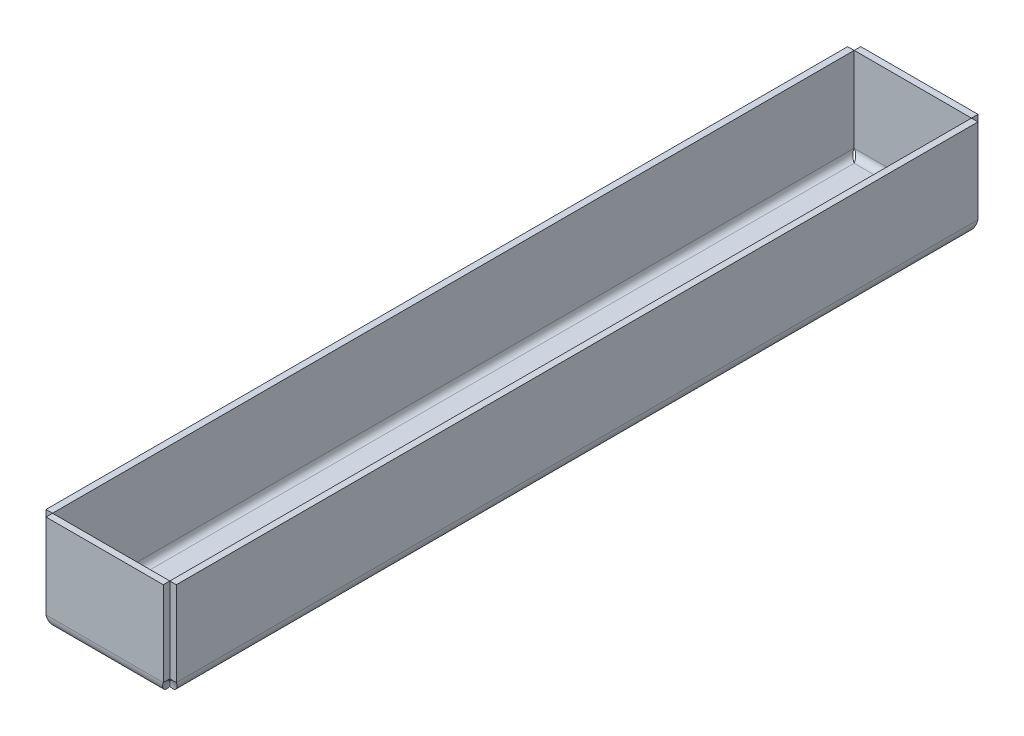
ISO-10303-21;
HEADER;
FILE_DESCRIPTION(('STEP AP214'),'2;1');
FILE_NAME('part.step','',(''),(''),'','','');
FILE_SCHEMA(('AUTOMOTIVE_DESIGN { 1 0 10303 214 1 1 1 1 }'));
ENDSEC;
DATA;
#1=APPLICATION_CONTEXT('core data for automotive mechanical design processes');
#2=APPLICATION_PROTOCOL_DEFINITION('international standard','automotive_design',2000,#1);
#3=PRODUCT_CONTEXT('',#1,'mechanical');
#4=PRODUCT('Part','Part','',(#3));
#5=PRODUCT_RELATED_PRODUCT_CATEGORY('part','',(#4));
#6=PRODUCT_DEFINITION_FORMATION('','',#4);
#7=PRODUCT_DEFINITION_CONTEXT('part definition',#1,'design');
#8=PRODUCT_DEFINITION('design','',#6,#7);
#9=PRODUCT_DEFINITION_SHAPE('','',#8);
#10=(LENGTH_UNIT() NAMED_UNIT(*) SI_UNIT(.MILLI.,.METRE.));
#11=(NAMED_UNIT(*) PLANE_ANGLE_UNIT() SI_UNIT($,.RADIAN.));
#12=(NAMED_UNIT(*) SI_UNIT($,.STERADIAN.) SOLID_ANGLE_UNIT());
#13=UNCERTAINTY_MEASURE_WITH_UNIT(LENGTH_MEASURE(1.E-05),#10,'distance_accuracy_value','');
#14=(GEOMETRIC_REPRESENTATION_CONTEXT(3) GLOBAL_UNCERTAINTY_ASSIGNED_CONTEXT((#13)) GLOBAL_UNIT_ASSIGNED_CONTEXT((#10,
#11,#12)) REPRESENTATION_CONTEXT('',''));
#15=CARTESIAN_POINT('',(0.,0.,0.));
#16=DIRECTION('',(0.,0.,1.));
#17=DIRECTION('',(1.,0.,0.));
#18=AXIS2_PLACEMENT_3D('',#15,#16,#17);
#19=CARTESIAN_POINT('',(476.700557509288,15.,125.));
#20=DIRECTION('',(0.,1.,0.));
#21=DIRECTION('',(-1.,0.,0.));
#22=AXIS2_PLACEMENT_3D('',#19,#20,#21);
#23=PLANE('',#22);
#24=DIRECTION('',(0.,0.,-1.));
#25=VECTOR('',#24,1.);
#26=CARTESIAN_POINT('',(-20.,15.,125.));
#27=LINE('',#26,#25);
#28=CARTESIAN_POINT('',(-20.,15.,122.99));
#29=VERTEX_POINT('',#28);
#30=CARTESIAN_POINT('',(-20.,15.,-122.99));
#31=VERTEX_POINT('',#30);
#32=EDGE_CURVE('E275',#29,#31,#27,.T.);
#33=ORIENTED_EDGE('',*,*,#32,.F.);
#34=DIRECTION('',(-1.,0.,0.));
#35=VECTOR('',#34,1.);
#36=CARTESIAN_POINT('',(476.700557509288,15.,122.99));
#37=LINE('',#36,#35);
#38=CARTESIAN_POINT('',(-18.,15.,122.99));
#39=VERTEX_POINT('',#38);
#40=EDGE_CURVE('E42',#39,#29,#37,.T.);
#41=ORIENTED_EDGE('',*,*,#40,.F.);
#42=DIRECTION('',(0.,0.,-1.));
#43=VECTOR('',#42,1.);
#44=CARTESIAN_POINT('',(-18.,15.,125.));
#45=LINE('',#44,#43);
#46=CARTESIAN_POINT('',(-18.,15.,-122.99));
#47=VERTEX_POINT('',#46);
#48=EDGE_CURVE('E50',#39,#47,#45,.T.);
#49=ORIENTED_EDGE('',*,*,#48,.T.);
#50=DIRECTION('',(-1.,0.,0.));
#51=VECTOR('',#50,1.);
#52=CARTESIAN_POINT('',(476.700557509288,15.,-122.99));
#53=LINE('',#52,#51);
#54=EDGE_CURVE('E249',#47,#31,#53,.T.);
#55=ORIENTED_EDGE('',*,*,#54,.T.);
#56=EDGE_LOOP('',(#33,#41,#49,#55));
#57=FACE_BOUND('',#56,.T.);
#58=ADVANCED_FACE('F31',(#57),#23,.T.);
#59=CARTESIAN_POINT('',(476.700557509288,-12.9999999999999,-122.99));
#60=DIRECTION('',(0.,0.,1.));
#61=DIRECTION('',(0.,-1.,0.));
#62=AXIS2_PLACEMENT_3D('',#59,#60,#61);
#63=PLANE('',#62);
#64=CARTESIAN_POINT('',(-20.,-11.,-122.99));
#65=CARTESIAN_POINT('',(-18.,-11.,-122.99));
#66=B_SPLINE_CURVE_WITH_KNOTS('',1,(#64,#65),.UNSPECIFIED.,.F.,.F.,(2,2),(0.,1.),.UNSPECIFIED.);
#67=CARTESIAN_POINT('',(-18.,-11.,-122.99));
#68=VERTEX_POINT('',#67);
#69=CARTESIAN_POINT('',(-20.,-11.,-122.99));
#70=VERTEX_POINT('',#69);
#71=EDGE_CURVE('E237',#68,#70,#66,.F.);
#72=ORIENTED_EDGE('',*,*,#71,.T.);
#73=DIRECTION('',(0.,1.,0.));
#74=VECTOR('',#73,1.);
#75=CARTESIAN_POINT('',(-20.,-15.,-122.99));
#76=LINE('',#75,#74);
#77=EDGE_CURVE('E65',#70,#31,#76,.T.);
#78=ORIENTED_EDGE('',*,*,#77,.T.);
#79=ORIENTED_EDGE('',*,*,#54,.F.);
#80=DIRECTION('',(0.,1.,0.));
#81=VECTOR('',#80,1.);
#82=CARTESIAN_POINT('',(-18.,-13.,-122.99));
#83=LINE('',#82,#81);
#84=EDGE_CURVE('E11',#68,#47,#83,.T.);
#85=ORIENTED_EDGE('',*,*,#84,.F.);
#86=EDGE_LOOP('',(#72,#78,#79,#85));
#87=FACE_BOUND('',#86,.T.);
#88=ADVANCED_FACE('F268',(#87),#63,.F.);
#89=CARTESIAN_POINT('',(-20.,15.,125.));
#90=DIRECTION('',(1.,0.,0.));
#91=DIRECTION('',(0.,1.,0.));
#92=AXIS2_PLACEMENT_3D('',#89,#90,#91);
#93=PLANE('',#92);
#94=ORIENTED_EDGE('',*,*,#77,.F.);
#95=DIRECTION('',(0.,0.,1.));
#96=VECTOR('',#95,1.);
#97=CARTESIAN_POINT('',(-20.,-11.,-122.99));
#98=LINE('',#97,#96);
#99=CARTESIAN_POINT('',(-20.,-11.,122.99));
#100=VERTEX_POINT('',#99);
#101=EDGE_CURVE('E278',#70,#100,#98,.T.);
#102=ORIENTED_EDGE('',*,*,#101,.T.);
#103=DIRECTION('',(0.,1.,0.));
#104=VECTOR('',#103,1.);
#105=CARTESIAN_POINT('',(-20.,-13.,122.99));
#106=LINE('',#105,#104);
#107=EDGE_CURVE('E281',#100,#29,#106,.T.);
#108=ORIENTED_EDGE('',*,*,#107,.T.);
#109=ORIENTED_EDGE('',*,*,#32,.T.);
#110=EDGE_LOOP('',(#94,#102,#108,#109));
#111=FACE_BOUND('',#110,.T.);
#112=ADVANCED_FACE('F304',(#111),#93,.F.);
#113=CARTESIAN_POINT('',(476.700557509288,-12.9999999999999,122.99));
#114=DIRECTION('',(0.,0.,1.));
#115=DIRECTION('',(0.,-1.,0.));
#116=AXIS2_PLACEMENT_3D('',#113,#114,#115);
#117=PLANE('',#116);
#118=ORIENTED_EDGE('',*,*,#107,.F.);
#119=CARTESIAN_POINT('',(-18.,-11.,122.99));
#120=CARTESIAN_POINT('',(-20.,-11.,122.99));
#121=B_SPLINE_CURVE_WITH_KNOTS('',1,(#119,#120),.UNSPECIFIED.,.F.,.F.,(2,2),(0.,1.),.UNSPECIFIED.);
#122=CARTESIAN_POINT('',(-18.,-11.,122.99));
#123=VERTEX_POINT('',#122);
#124=EDGE_CURVE('E266',#123,#100,#121,.T.);
#125=ORIENTED_EDGE('',*,*,#124,.F.);
#126=DIRECTION('',(0.,1.,0.));
#127=VECTOR('',#126,1.);
#128=CARTESIAN_POINT('',(-18.,-13.,122.99));
#129=LINE('',#128,#127);
#130=EDGE_CURVE('E264',#123,#39,#129,.T.);
#131=ORIENTED_EDGE('',*,*,#130,.T.);
#132=ORIENTED_EDGE('',*,*,#40,.T.);
#133=EDGE_LOOP('',(#118,#125,#131,#132));
#134=FACE_BOUND('',#133,.T.);
#135=ADVANCED_FACE('F307',(#134),#117,.T.);
#136=CARTESIAN_POINT('',(-18.,15.,125.));
#137=DIRECTION('',(1.,0.,0.));
#138=DIRECTION('',(0.,1.,0.));
#139=AXIS2_PLACEMENT_3D('',#136,#137,#138);
#140=PLANE('',#139);
#141=DIRECTION('',(0.,0.,1.));
#142=VECTOR('',#141,1.);
#143=CARTESIAN_POINT('',(-18.,-11.,-122.99));
#144=LINE('',#143,#142);
#145=EDGE_CURVE('E258',#68,#123,#144,.T.);
#146=ORIENTED_EDGE('',*,*,#145,.F.);
#147=ORIENTED_EDGE('',*,*,#84,.T.);
#148=ORIENTED_EDGE('',*,*,#48,.F.);
#149=ORIENTED_EDGE('',*,*,#130,.F.);
#150=EDGE_LOOP('',(#146,#147,#148,#149));
#151=FACE_BOUND('',#150,.T.);
#152=ADVANCED_FACE('F33',(#151),#140,.T.);
#153=CARTESIAN_POINT('',(-476.700557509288,15.0000000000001,125.));
#154=DIRECTION('',(0.,-1.,0.));
#155=DIRECTION('',(1.,0.,0.));
#156=AXIS2_PLACEMENT_3D('',#153,#154,#155);
#157=PLANE('',#156);
#158=DIRECTION('',(1.,0.,0.));
#159=VECTOR('',#158,1.);
#160=CARTESIAN_POINT('',(-476.700557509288,15.0000000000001,122.99));
#161=LINE('',#160,#159);
#162=CARTESIAN_POINT('',(18.,15.,122.99));
#163=VERTEX_POINT('',#162);
#164=CARTESIAN_POINT('',(20.,15.,122.99));
#165=VERTEX_POINT('',#164);
#166=EDGE_CURVE('E364',#163,#165,#161,.T.);
#167=ORIENTED_EDGE('',*,*,#166,.T.);
#168=DIRECTION('',(0.,0.,-1.));
#169=VECTOR('',#168,1.);
#170=CARTESIAN_POINT('',(20.,15.,125.));
#171=LINE('',#170,#169);
#172=CARTESIAN_POINT('',(20.,15.,-122.99));
#173=VERTEX_POINT('',#172);
#174=EDGE_CURVE('E1073',#165,#173,#171,.T.);
#175=ORIENTED_EDGE('',*,*,#174,.T.);
#176=DIRECTION('',(1.,0.,0.));
#177=VECTOR('',#176,1.);
#178=CARTESIAN_POINT('',(-476.700557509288,15.0000000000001,-122.99));
#179=LINE('',#178,#177);
#180=CARTESIAN_POINT('',(18.,15.,-122.99));
#181=VERTEX_POINT('',#180);
#182=EDGE_CURVE('E365',#181,#173,#179,.T.);
#183=ORIENTED_EDGE('',*,*,#182,.F.);
#184=DIRECTION('',(0.,0.,-1.));
#185=VECTOR('',#184,1.);
#186=CARTESIAN_POINT('',(18.,15.,125.));
#187=LINE('',#186,#185);
#188=EDGE_CURVE('E83',#163,#181,#187,.T.);
#189=ORIENTED_EDGE('',*,*,#188,.F.);
#190=EDGE_LOOP('',(#167,#175,#183,#189));
#191=FACE_BOUND('',#190,.T.);
#192=ADVANCED_FACE('F315',(#191),#157,.F.);
#193=CARTESIAN_POINT('',(-476.700557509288,-12.9999999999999,122.99));
#194=DIRECTION('',(0.,0.,-1.));
#195=DIRECTION('',(0.,-1.,0.));
#196=AXIS2_PLACEMENT_3D('',#193,#194,#195);
#197=PLANE('',#196);
#198=CARTESIAN_POINT('',(20.,-11.,122.99));
#199=CARTESIAN_POINT('',(18.,-11.,122.99));
#200=B_SPLINE_CURVE_WITH_KNOTS('',1,(#198,#199),.UNSPECIFIED.,.F.,.F.,(2,2),(0.,1.),.UNSPECIFIED.);
#201=CARTESIAN_POINT('',(18.,-11.,122.99));
#202=VERTEX_POINT('',#201);
#203=CARTESIAN_POINT('',(20.,-11.,122.99));
#204=VERTEX_POINT('',#203);
#205=EDGE_CURVE('E362',#202,#204,#200,.F.);
#206=ORIENTED_EDGE('',*,*,#205,.T.);
#207=DIRECTION('',(0.,1.,0.));
#208=VECTOR('',#207,1.);
#209=CARTESIAN_POINT('',(20.,-15.,122.99));
#210=LINE('',#209,#208);
#211=EDGE_CURVE('E98',#204,#165,#210,.T.);
#212=ORIENTED_EDGE('',*,*,#211,.T.);
#213=ORIENTED_EDGE('',*,*,#166,.F.);
#214=DIRECTION('',(0.,1.,0.));
#215=VECTOR('',#214,1.);
#216=CARTESIAN_POINT('',(18.,-13.,122.99));
#217=LINE('',#216,#215);
#218=EDGE_CURVE('E353',#202,#163,#217,.T.);
#219=ORIENTED_EDGE('',*,*,#218,.F.);
#220=EDGE_LOOP('',(#206,#212,#213,#219));
#221=FACE_BOUND('',#220,.T.);
#222=ADVANCED_FACE('F361',(#221),#197,.F.);
#223=CARTESIAN_POINT('',(20.,15.,125.));
#224=DIRECTION('',(-1.,0.,0.));
#225=DIRECTION('',(0.,-1.,0.));
#226=AXIS2_PLACEMENT_3D('',#223,#224,#225);
#227=PLANE('',#226);
#228=ORIENTED_EDGE('',*,*,#211,.F.);
#229=DIRECTION('',(0.,0.,-1.));
#230=VECTOR('',#229,1.);
#231=CARTESIAN_POINT('',(20.,-11.,122.99));
#232=LINE('',#231,#230);
#233=CARTESIAN_POINT('',(20.,-11.,-122.99));
#234=VERTEX_POINT('',#233);
#235=EDGE_CURVE('E378',#204,#234,#232,.T.);
#236=ORIENTED_EDGE('',*,*,#235,.T.);
#237=DIRECTION('',(0.,1.,0.));
#238=VECTOR('',#237,1.);
#239=CARTESIAN_POINT('',(20.,-13.,-122.99));
#240=LINE('',#239,#238);
#241=EDGE_CURVE('E374',#234,#173,#240,.T.);
#242=ORIENTED_EDGE('',*,*,#241,.T.);
#243=ORIENTED_EDGE('',*,*,#174,.F.);
#244=EDGE_LOOP('',(#228,#236,#242,#243));
#245=FACE_BOUND('',#244,.T.);
#246=ADVANCED_FACE('F339',(#245),#227,.F.);
#247=CARTESIAN_POINT('',(-476.700557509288,-12.9999999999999,-122.99));
#248=DIRECTION('',(0.,0.,-1.));
#249=DIRECTION('',(0.,-1.,0.));
#250=AXIS2_PLACEMENT_3D('',#247,#248,#249);
#251=PLANE('',#250);
#252=ORIENTED_EDGE('',*,*,#241,.F.);
#253=CARTESIAN_POINT('',(18.,-11.,-122.99));
#254=CARTESIAN_POINT('',(20.,-11.,-122.99));
#255=B_SPLINE_CURVE_WITH_KNOTS('',1,(#253,#254),.UNSPECIFIED.,.F.,.F.,(2,2),(0.,1.),.UNSPECIFIED.);
#256=CARTESIAN_POINT('',(18.,-11.,-122.99));
#257=VERTEX_POINT('',#256);
#258=EDGE_CURVE('E359',#257,#234,#255,.T.);
#259=ORIENTED_EDGE('',*,*,#258,.F.);
#260=DIRECTION('',(0.,1.,0.));
#261=VECTOR('',#260,1.);
#262=CARTESIAN_POINT('',(18.,-13.,-122.99));
#263=LINE('',#262,#261);
#264=EDGE_CURVE('E354',#257,#181,#263,.T.);
#265=ORIENTED_EDGE('',*,*,#264,.T.);
#266=ORIENTED_EDGE('',*,*,#182,.T.);
#267=EDGE_LOOP('',(#252,#259,#265,#266));
#268=FACE_BOUND('',#267,.T.);
#269=ADVANCED_FACE('F329',(#268),#251,.T.);
#270=CARTESIAN_POINT('',(18.,15.,125.));
#271=DIRECTION('',(-1.,0.,0.));
#272=DIRECTION('',(0.,-1.,0.));
#273=AXIS2_PLACEMENT_3D('',#270,#271,#272);
#274=PLANE('',#273);
#275=DIRECTION('',(0.,0.,-1.));
#276=VECTOR('',#275,1.);
#277=CARTESIAN_POINT('',(18.,-11.,122.99));
#278=LINE('',#277,#276);
#279=EDGE_CURVE('E351',#202,#257,#278,.T.);
#280=ORIENTED_EDGE('',*,*,#279,.F.);
#281=ORIENTED_EDGE('',*,*,#218,.T.);
#282=ORIENTED_EDGE('',*,*,#188,.T.);
#283=ORIENTED_EDGE('',*,*,#264,.F.);
#284=EDGE_LOOP('',(#280,#281,#282,#283));
#285=FACE_BOUND('',#284,.T.);
#286=ADVANCED_FACE('F338',(#285),#274,.T.);
#287=CARTESIAN_POINT('',(-20.,15.,34.2180108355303));
#288=DIRECTION('',(0.,1.,0.));
#289=DIRECTION('',(0.,0.,1.));
#290=AXIS2_PLACEMENT_3D('',#287,#288,#289);
#291=PLANE('',#290);
#292=DIRECTION('',(0.,0.,1.));
#293=VECTOR('',#292,1.);
#294=CARTESIAN_POINT('',(-17.99,15.,34.2180108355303));
#295=LINE('',#294,#293);
#296=CARTESIAN_POINT('',(-17.99,15.,123.));
#297=VERTEX_POINT('',#296);
#298=CARTESIAN_POINT('',(-17.99,15.,125.));
#299=VERTEX_POINT('',#298);
#300=EDGE_CURVE('E492',#297,#299,#295,.T.);
#301=ORIENTED_EDGE('',*,*,#300,.T.);
#302=DIRECTION('',(-1.,0.,0.));
#303=VECTOR('',#302,1.);
#304=CARTESIAN_POINT('',(-20.,15.,125.));
#305=LINE('',#304,#303);
#306=CARTESIAN_POINT('',(17.99,15.,125.));
#307=VERTEX_POINT('',#306);
#308=EDGE_CURVE('E487',#307,#299,#305,.T.);
#309=ORIENTED_EDGE('',*,*,#308,.F.);
#310=DIRECTION('',(0.,0.,1.));
#311=VECTOR('',#310,1.);
#312=CARTESIAN_POINT('',(17.99,15.,34.2180108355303));
#313=LINE('',#312,#311);
#314=CARTESIAN_POINT('',(17.99,15.,123.));
#315=VERTEX_POINT('',#314);
#316=EDGE_CURVE('E485',#315,#307,#313,.T.);
#317=ORIENTED_EDGE('',*,*,#316,.F.);
#318=DIRECTION('',(-1.,0.,0.));
#319=VECTOR('',#318,1.);
#320=CARTESIAN_POINT('',(-20.,15.,123.));
#321=LINE('',#320,#319);
#322=EDGE_CURVE('E489',#315,#297,#321,.T.);
#323=ORIENTED_EDGE('',*,*,#322,.T.);
#324=EDGE_LOOP('',(#301,#309,#317,#323));
#325=FACE_BOUND('',#324,.T.);
#326=ADVANCED_FACE('F343',(#325),#291,.T.);
#327=CARTESIAN_POINT('',(-17.99,-13.,34.2180108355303));
#328=DIRECTION('',(1.,0.,0.));
#329=DIRECTION('',(0.,-1.,0.));
#330=AXIS2_PLACEMENT_3D('',#327,#328,#329);
#331=PLANE('',#330);
#332=DIRECTION('',(0.,1.,0.));
#333=VECTOR('',#332,1.);
#334=CARTESIAN_POINT('',(-17.99,-15.,125.));
#335=LINE('',#334,#333);
#336=CARTESIAN_POINT('',(-17.99,-11.,125.));
#337=VERTEX_POINT('',#336);
#338=EDGE_CURVE('E491',#337,#299,#335,.T.);
#339=ORIENTED_EDGE('',*,*,#338,.T.);
#340=ORIENTED_EDGE('',*,*,#300,.F.);
#341=DIRECTION('',(0.,1.,0.));
#342=VECTOR('',#341,1.);
#343=CARTESIAN_POINT('',(-17.99,-13.,123.));
#344=LINE('',#343,#342);
#345=CARTESIAN_POINT('',(-17.99,-11.,123.));
#346=VERTEX_POINT('',#345);
#347=EDGE_CURVE('E143',#346,#297,#344,.T.);
#348=ORIENTED_EDGE('',*,*,#347,.F.);
#349=CARTESIAN_POINT('',(-17.99,-11.,125.));
#350=CARTESIAN_POINT('',(-17.99,-11.,123.));
#351=B_SPLINE_CURVE_WITH_KNOTS('',1,(#349,#350),.UNSPECIFIED.,.F.,.F.,(2,2),(0.,1.),.UNSPECIFIED.);
#352=EDGE_CURVE('E441',#346,#337,#351,.F.);
#353=ORIENTED_EDGE('',*,*,#352,.T.);
#354=EDGE_LOOP('',(#339,#340,#348,#353));
#355=FACE_BOUND('',#354,.T.);
#356=ADVANCED_FACE('F347',(#355),#331,.F.);
#357=CARTESIAN_POINT('',(-20.,-15.,125.));
#358=DIRECTION('',(0.,0.,1.));
#359=DIRECTION('',(1.,0.,0.));
#360=AXIS2_PLACEMENT_3D('',#357,#358,#359);
#361=PLANE('',#360);
#362=DIRECTION('',(-1.,0.,0.));
#363=VECTOR('',#362,1.);
#364=CARTESIAN_POINT('',(-17.99,-11.,125.));
#365=LINE('',#364,#363);
#366=CARTESIAN_POINT('',(17.99,-11.,125.));
#367=VERTEX_POINT('',#366);
#368=EDGE_CURVE('E495',#367,#337,#365,.T.);
#369=ORIENTED_EDGE('',*,*,#368,.F.);
#370=DIRECTION('',(0.,-1.,0.));
#371=VECTOR('',#370,1.);
#372=CARTESIAN_POINT('',(17.99,-13.,125.));
#373=LINE('',#372,#371);
#374=EDGE_CURVE('E432',#307,#367,#373,.T.);
#375=ORIENTED_EDGE('',*,*,#374,.F.);
#376=ORIENTED_EDGE('',*,*,#308,.T.);
#377=ORIENTED_EDGE('',*,*,#338,.F.);
#378=EDGE_LOOP('',(#369,#375,#376,#377));
#379=FACE_BOUND('',#378,.T.);
#380=ADVANCED_FACE('F415',(#379),#361,.T.);
#381=CARTESIAN_POINT('',(17.99,-13.,34.2180108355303));
#382=DIRECTION('',(1.,0.,0.));
#383=DIRECTION('',(0.,-1.,0.));
#384=AXIS2_PLACEMENT_3D('',#381,#382,#383);
#385=PLANE('',#384);
#386=ORIENTED_EDGE('',*,*,#316,.T.);
#387=ORIENTED_EDGE('',*,*,#374,.T.);
#388=CARTESIAN_POINT('',(17.99,-11.,123.));
#389=CARTESIAN_POINT('',(17.99,-11.,125.));
#390=B_SPLINE_CURVE_WITH_KNOTS('',1,(#388,#389),.UNSPECIFIED.,.F.,.F.,(2,2),(0.,1.),.UNSPECIFIED.);
#391=CARTESIAN_POINT('',(17.99,-11.,123.));
#392=VERTEX_POINT('',#391);
#393=EDGE_CURVE('E135',#392,#367,#390,.T.);
#394=ORIENTED_EDGE('',*,*,#393,.F.);
#395=DIRECTION('',(0.,-1.,0.));
#396=VECTOR('',#395,1.);
#397=CARTESIAN_POINT('',(17.99,-13.,123.));
#398=LINE('',#397,#396);
#399=EDGE_CURVE('E116',#315,#392,#398,.T.);
#400=ORIENTED_EDGE('',*,*,#399,.F.);
#401=EDGE_LOOP('',(#386,#387,#394,#400));
#402=FACE_BOUND('',#401,.T.);
#403=ADVANCED_FACE('F410',(#402),#385,.T.);
#404=CARTESIAN_POINT('',(-20.,-15.,123.));
#405=DIRECTION('',(0.,0.,1.));
#406=DIRECTION('',(1.,0.,0.));
#407=AXIS2_PLACEMENT_3D('',#404,#405,#406);
#408=PLANE('',#407);
#409=ORIENTED_EDGE('',*,*,#399,.T.);
#410=DIRECTION('',(-1.,0.,0.));
#411=VECTOR('',#410,1.);
#412=CARTESIAN_POINT('',(-17.99,-11.,123.));
#413=LINE('',#412,#411);
#414=EDGE_CURVE('E422',#392,#346,#413,.T.);
#415=ORIENTED_EDGE('',*,*,#414,.T.);
#416=ORIENTED_EDGE('',*,*,#347,.T.);
#417=ORIENTED_EDGE('',*,*,#322,.F.);
#418=EDGE_LOOP('',(#409,#415,#416,#417));
#419=FACE_BOUND('',#418,.T.);
#420=ADVANCED_FACE('F406',(#419),#408,.F.);
#421=CARTESIAN_POINT('',(-20.,15.,-34.2180108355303));
#422=DIRECTION('',(0.,-1.,0.));
#423=DIRECTION('',(0.,0.,-1.));
#424=AXIS2_PLACEMENT_3D('',#421,#422,#423);
#425=PLANE('',#424);
#426=DIRECTION('',(0.,0.,-1.));
#427=VECTOR('',#426,1.);
#428=CARTESIAN_POINT('',(17.99,15.,-34.2180108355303));
#429=LINE('',#428,#427);
#430=CARTESIAN_POINT('',(17.99,15.,-123.));
#431=VERTEX_POINT('',#430);
#432=CARTESIAN_POINT('',(17.99,15.,-125.));
#433=VERTEX_POINT('',#432);
#434=EDGE_CURVE('E1120',#431,#433,#429,.T.);
#435=ORIENTED_EDGE('',*,*,#434,.T.);
#436=DIRECTION('',(-1.,0.,0.));
#437=VECTOR('',#436,1.);
#438=CARTESIAN_POINT('',(-20.,15.,-125.));
#439=LINE('',#438,#437);
#440=CARTESIAN_POINT('',(-17.99,15.,-125.));
#441=VERTEX_POINT('',#440);
#442=EDGE_CURVE('E1117',#433,#441,#439,.T.);
#443=ORIENTED_EDGE('',*,*,#442,.T.);
#444=DIRECTION('',(0.,0.,-1.));
#445=VECTOR('',#444,1.);
#446=CARTESIAN_POINT('',(-17.99,15.,-34.2180108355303));
#447=LINE('',#446,#445);
#448=CARTESIAN_POINT('',(-17.99,15.,-123.));
#449=VERTEX_POINT('',#448);
#450=EDGE_CURVE('E1095',#449,#441,#447,.T.);
#451=ORIENTED_EDGE('',*,*,#450,.F.);
#452=DIRECTION('',(-1.,0.,0.));
#453=VECTOR('',#452,1.);
#454=CARTESIAN_POINT('',(-20.,15.,-123.));
#455=LINE('',#454,#453);
#456=EDGE_CURVE('E152',#431,#449,#455,.T.);
#457=ORIENTED_EDGE('',*,*,#456,.F.);
#458=EDGE_LOOP('',(#435,#443,#451,#457));
#459=FACE_BOUND('',#458,.T.);
#460=ADVANCED_FACE('F409',(#459),#425,.F.);
#461=CARTESIAN_POINT('',(17.99,-13.,-34.2180108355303));
#462=DIRECTION('',(-1.,0.,0.));
#463=DIRECTION('',(0.,-1.,0.));
#464=AXIS2_PLACEMENT_3D('',#461,#462,#463);
#465=PLANE('',#464);
#466=CARTESIAN_POINT('',(17.99,-11.,-125.));
#467=CARTESIAN_POINT('',(17.99,-11.,-123.));
#468=B_SPLINE_CURVE_WITH_KNOTS('',1,(#466,#467),.UNSPECIFIED.,.F.,.F.,(2,2),(0.,1.),.UNSPECIFIED.);
#469=CARTESIAN_POINT('',(17.99,-11.,-123.));
#470=VERTEX_POINT('',#469);
#471=CARTESIAN_POINT('',(17.99,-11.,-125.));
#472=VERTEX_POINT('',#471);
#473=EDGE_CURVE('E1115',#470,#472,#468,.F.);
#474=ORIENTED_EDGE('',*,*,#473,.T.);
#475=DIRECTION('',(0.,1.,0.));
#476=VECTOR('',#475,1.);
#477=CARTESIAN_POINT('',(17.99,-15.,-125.));
#478=LINE('',#477,#476);
#479=EDGE_CURVE('E167',#472,#433,#478,.T.);
#480=ORIENTED_EDGE('',*,*,#479,.T.);
#481=ORIENTED_EDGE('',*,*,#434,.F.);
#482=DIRECTION('',(0.,1.,0.));
#483=VECTOR('',#482,1.);
#484=CARTESIAN_POINT('',(17.99,-13.,-123.));
#485=LINE('',#484,#483);
#486=EDGE_CURVE('E1093',#470,#431,#485,.T.);
#487=ORIENTED_EDGE('',*,*,#486,.F.);
#488=EDGE_LOOP('',(#474,#480,#481,#487));
#489=FACE_BOUND('',#488,.T.);
#490=ADVANCED_FACE('F1001',(#489),#465,.F.);
#491=CARTESIAN_POINT('',(-20.,-15.,-125.));
#492=DIRECTION('',(0.,0.,1.));
#493=DIRECTION('',(1.,0.,0.));
#494=AXIS2_PLACEMENT_3D('',#491,#492,#493);
#495=PLANE('',#494);
#496=ORIENTED_EDGE('',*,*,#479,.F.);
#497=DIRECTION('',(-1.,0.,0.));
#498=VECTOR('',#497,1.);
#499=CARTESIAN_POINT('',(17.99,-11.,-125.));
#500=LINE('',#499,#498);
#501=CARTESIAN_POINT('',(-17.99,-11.,-125.));
#502=VERTEX_POINT('',#501);
#503=EDGE_CURVE('E1104',#472,#502,#500,.T.);
#504=ORIENTED_EDGE('',*,*,#503,.T.);
#505=DIRECTION('',(0.,1.,0.));
#506=VECTOR('',#505,1.);
#507=CARTESIAN_POINT('',(-17.99,-13.,-125.));
#508=LINE('',#507,#506);
#509=EDGE_CURVE('E1099',#502,#441,#508,.T.);
#510=ORIENTED_EDGE('',*,*,#509,.T.);
#511=ORIENTED_EDGE('',*,*,#442,.F.);
#512=EDGE_LOOP('',(#496,#504,#510,#511));
#513=FACE_BOUND('',#512,.T.);
#514=ADVANCED_FACE('F461',(#513),#495,.F.);
#515=CARTESIAN_POINT('',(-17.99,-13.,-34.2180108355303));
#516=DIRECTION('',(-1.,0.,0.));
#517=DIRECTION('',(0.,-1.,0.));
#518=AXIS2_PLACEMENT_3D('',#515,#516,#517);
#519=PLANE('',#518);
#520=ORIENTED_EDGE('',*,*,#509,.F.);
#521=CARTESIAN_POINT('',(-17.99,-11.,-123.));
#522=CARTESIAN_POINT('',(-17.99,-11.,-125.));
#523=B_SPLINE_CURVE_WITH_KNOTS('',1,(#521,#522),.UNSPECIFIED.,.F.,.F.,(2,2),(0.,1.),.UNSPECIFIED.);
#524=CARTESIAN_POINT('',(-17.99,-11.,-123.));
#525=VERTEX_POINT('',#524);
#526=EDGE_CURVE('E1090',#525,#502,#523,.T.);
#527=ORIENTED_EDGE('',*,*,#526,.F.);
#528=DIRECTION('',(0.,1.,0.));
#529=VECTOR('',#528,1.);
#530=CARTESIAN_POINT('',(-17.99,-13.,-123.));
#531=LINE('',#530,#529);
#532=EDGE_CURVE('E1098',#525,#449,#531,.T.);
#533=ORIENTED_EDGE('',*,*,#532,.T.);
#534=ORIENTED_EDGE('',*,*,#450,.T.);
#535=EDGE_LOOP('',(#520,#527,#533,#534));
#536=FACE_BOUND('',#535,.T.);
#537=ADVANCED_FACE('F457',(#536),#519,.T.);
#538=CARTESIAN_POINT('',(-20.,-15.,-123.));
#539=DIRECTION('',(0.,0.,1.));
#540=DIRECTION('',(1.,0.,0.));
#541=AXIS2_PLACEMENT_3D('',#538,#539,#540);
#542=PLANE('',#541);
#543=DIRECTION('',(-1.,0.,0.));
#544=VECTOR('',#543,1.);
#545=CARTESIAN_POINT('',(17.99,-11.,-123.));
#546=LINE('',#545,#544);
#547=EDGE_CURVE('E477',#470,#525,#546,.T.);
#548=ORIENTED_EDGE('',*,*,#547,.F.);
#549=ORIENTED_EDGE('',*,*,#486,.T.);
#550=ORIENTED_EDGE('',*,*,#456,.T.);
#551=ORIENTED_EDGE('',*,*,#532,.F.);
#552=EDGE_LOOP('',(#548,#549,#550,#551));
#553=FACE_BOUND('',#552,.T.);
#554=ADVANCED_FACE('F453',(#553),#542,.T.);
#555=CARTESIAN_POINT('',(-20.,-15.,125.));
#556=DIRECTION('',(0.,1.,0.));
#557=DIRECTION('',(0.,0.,1.));
#558=AXIS2_PLACEMENT_3D('',#555,#556,#557);
#559=PLANE('',#558);
#560=CARTESIAN_POINT('',(0.,-15.,0.));
#561=DIRECTION('',(0.,1.,0.));
#562=DIRECTION('',(0.,0.,1.));
#563=AXIS2_PLACEMENT_3D('',#560,#561,#562);
#564=CIRCLE('',#563,5.25);
#565=CARTESIAN_POINT('',(0.,-15.,5.25));
#566=VERTEX_POINT('',#565);
#567=EDGE_CURVE('E633',#566,#566,#564,.T.);
#568=ORIENTED_EDGE('',*,*,#567,.T.);
#569=EDGE_LOOP('',(#568));
#570=FACE_BOUND('',#569,.T.);
#571=CARTESIAN_POINT('',(0.,-15.,-55.));
#572=DIRECTION('',(0.,1.,0.));
#573=DIRECTION('',(0.,0.,1.));
#574=AXIS2_PLACEMENT_3D('',#571,#572,#573);
#575=CIRCLE('',#574,5.25);
#576=CARTESIAN_POINT('',(0.,-15.,-49.75));
#577=VERTEX_POINT('',#576);
#578=EDGE_CURVE('E1145',#577,#577,#575,.T.);
#579=ORIENTED_EDGE('',*,*,#578,.T.);
#580=EDGE_LOOP('',(#579));
#581=FACE_BOUND('',#580,.T.);
#582=CARTESIAN_POINT('',(0.,-15.,-110.));
#583=DIRECTION('',(0.,1.,0.));
#584=DIRECTION('',(0.,0.,1.));
#585=AXIS2_PLACEMENT_3D('',#582,#583,#584);
#586=CIRCLE('',#585,5.25);
#587=CARTESIAN_POINT('',(0.,-15.,-104.75));
#588=VERTEX_POINT('',#587);
#589=EDGE_CURVE('E1148',#588,#588,#586,.T.);
#590=ORIENTED_EDGE('',*,*,#589,.T.);
#591=EDGE_LOOP('',(#590));
#592=FACE_BOUND('',#591,.T.);
#593=CARTESIAN_POINT('',(0.,-15.,55.));
#594=DIRECTION('',(0.,1.,0.));
#595=DIRECTION('',(0.,0.,1.));
#596=AXIS2_PLACEMENT_3D('',#593,#594,#595);
#597=CIRCLE('',#596,5.25);
#598=CARTESIAN_POINT('',(0.,-15.,60.25));
#599=VERTEX_POINT('',#598);
#600=EDGE_CURVE('E1151',#599,#599,#597,.T.);
#601=ORIENTED_EDGE('',*,*,#600,.T.);
#602=EDGE_LOOP('',(#601));
#603=FACE_BOUND('',#602,.T.);
#604=CARTESIAN_POINT('',(0.,-15.,110.));
#605=DIRECTION('',(0.,1.,0.));
#606=DIRECTION('',(0.,0.,1.));
#607=AXIS2_PLACEMENT_3D('',#604,#605,#606);
#608=CIRCLE('',#607,5.25);
#609=CARTESIAN_POINT('',(0.,-15.,115.25));
#610=VERTEX_POINT('',#609);
#611=EDGE_CURVE('E1154',#610,#610,#608,.T.);
#612=ORIENTED_EDGE('',*,*,#611,.T.);
#613=EDGE_LOOP('',(#612));
#614=FACE_BOUND('',#613,.T.);
#615=DIRECTION('',(0.,0.,-1.));
#616=VECTOR('',#615,1.);
#617=CARTESIAN_POINT('',(16.,-15.,122.99));
#618=LINE('',#617,#616);
#619=CARTESIAN_POINT('',(16.,-15.,121.));
#620=VERTEX_POINT('',#619);
#621=CARTESIAN_POINT('',(16.,-15.,-121.));
#622=VERTEX_POINT('',#621);
#623=EDGE_CURVE('E482',#620,#622,#618,.T.);
#624=ORIENTED_EDGE('',*,*,#623,.F.);
#625=DIRECTION('',(1.,0.,0.));
#626=VECTOR('',#625,1.);
#627=CARTESIAN_POINT('',(-17.99,-15.,121.));
#628=LINE('',#627,#626);
#629=CARTESIAN_POINT('',(-16.,-15.,121.));
#630=VERTEX_POINT('',#629);
#631=EDGE_CURVE('E191',#630,#620,#628,.T.);
#632=ORIENTED_EDGE('',*,*,#631,.F.);
#633=DIRECTION('',(0.,0.,1.));
#634=VECTOR('',#633,1.);
#635=CARTESIAN_POINT('',(-16.,-15.,-122.99));
#636=LINE('',#635,#634);
#637=CARTESIAN_POINT('',(-16.,-15.,-121.));
#638=VERTEX_POINT('',#637);
#639=EDGE_CURVE('E678',#638,#630,#636,.T.);
#640=ORIENTED_EDGE('',*,*,#639,.F.);
#641=DIRECTION('',(-1.,0.,0.));
#642=VECTOR('',#641,1.);
#643=CARTESIAN_POINT('',(17.99,-15.,-121.));
#644=LINE('',#643,#642);
#645=EDGE_CURVE('E1136',#622,#638,#644,.T.);
#646=ORIENTED_EDGE('',*,*,#645,.F.);
#647=EDGE_LOOP('',(#624,#632,#640,#646));
#648=FACE_BOUND('',#647,.T.);
#649=ADVANCED_FACE('F456',(#570,#581,#592,#603,#614,#648),#559,.F.);
#650=CARTESIAN_POINT('',(-20.,-13.,125.));
#651=DIRECTION('',(0.,1.,0.));
#652=DIRECTION('',(0.,0.,1.));
#653=AXIS2_PLACEMENT_3D('',#650,#651,#652);
#654=PLANE('',#653);
#655=CARTESIAN_POINT('',(0.,-13.,0.));
#656=DIRECTION('',(0.,1.,0.));
#657=DIRECTION('',(0.,0.,1.));
#658=AXIS2_PLACEMENT_3D('',#655,#656,#657);
#659=CIRCLE('',#658,5.25);
#660=CARTESIAN_POINT('',(0.,-13.,5.25));
#661=VERTEX_POINT('',#660);
#662=EDGE_CURVE('E1157',#661,#661,#659,.T.);
#663=ORIENTED_EDGE('',*,*,#662,.F.);
#664=EDGE_LOOP('',(#663));
#665=FACE_BOUND('',#664,.T.);
#666=CARTESIAN_POINT('',(0.,-13.,-55.));
#667=DIRECTION('',(0.,1.,0.));
#668=DIRECTION('',(0.,0.,1.));
#669=AXIS2_PLACEMENT_3D('',#666,#667,#668);
#670=CIRCLE('',#669,5.25);
#671=CARTESIAN_POINT('',(0.,-13.,-49.75));
#672=VERTEX_POINT('',#671);
#673=EDGE_CURVE('E1160',#672,#672,#670,.T.);
#674=ORIENTED_EDGE('',*,*,#673,.F.);
#675=EDGE_LOOP('',(#674));
#676=FACE_BOUND('',#675,.T.);
#677=CARTESIAN_POINT('',(0.,-13.,-110.));
#678=DIRECTION('',(0.,1.,0.));
#679=DIRECTION('',(0.,0.,1.));
#680=AXIS2_PLACEMENT_3D('',#677,#678,#679);
#681=CIRCLE('',#680,5.25);
#682=CARTESIAN_POINT('',(0.,-13.,-104.75));
#683=VERTEX_POINT('',#682);
#684=EDGE_CURVE('E1163',#683,#683,#681,.T.);
#685=ORIENTED_EDGE('',*,*,#684,.F.);
#686=EDGE_LOOP('',(#685));
#687=FACE_BOUND('',#686,.T.);
#688=CARTESIAN_POINT('',(0.,-13.,55.));
#689=DIRECTION('',(0.,1.,0.));
#690=DIRECTION('',(0.,0.,1.));
#691=AXIS2_PLACEMENT_3D('',#688,#689,#690);
#692=CIRCLE('',#691,5.25);
#693=CARTESIAN_POINT('',(0.,-13.,60.25));
#694=VERTEX_POINT('',#693);
#695=EDGE_CURVE('E1166',#694,#694,#692,.T.);
#696=ORIENTED_EDGE('',*,*,#695,.F.);
#697=EDGE_LOOP('',(#696));
#698=FACE_BOUND('',#697,.T.);
#699=CARTESIAN_POINT('',(0.,-13.,110.));
#700=DIRECTION('',(0.,1.,0.));
#701=DIRECTION('',(0.,0.,1.));
#702=AXIS2_PLACEMENT_3D('',#699,#700,#701);
#703=CIRCLE('',#702,5.25);
#704=CARTESIAN_POINT('',(0.,-13.,115.25));
#705=VERTEX_POINT('',#704);
#706=EDGE_CURVE('E1169',#705,#705,#703,.T.);
#707=ORIENTED_EDGE('',*,*,#706,.F.);
#708=EDGE_LOOP('',(#707));
#709=FACE_BOUND('',#708,.T.);
#710=DIRECTION('',(1.,0.,0.));
#711=VECTOR('',#710,1.);
#712=CARTESIAN_POINT('',(-17.99,-13.,121.));
#713=LINE('',#712,#711);
#714=CARTESIAN_POINT('',(-16.,-13.,121.));
#715=VERTEX_POINT('',#714);
#716=CARTESIAN_POINT('',(16.,-13.,121.));
#717=VERTEX_POINT('',#716);
#718=EDGE_CURVE('E478',#715,#717,#713,.T.);
#719=ORIENTED_EDGE('',*,*,#718,.T.);
#720=DIRECTION('',(0.,0.,-1.));
#721=VECTOR('',#720,1.);
#722=CARTESIAN_POINT('',(16.,-13.,122.99));
#723=LINE('',#722,#721);
#724=CARTESIAN_POINT('',(16.,-13.,-121.));
#725=VERTEX_POINT('',#724);
#726=EDGE_CURVE('E774',#717,#725,#723,.T.);
#727=ORIENTED_EDGE('',*,*,#726,.T.);
#728=DIRECTION('',(-1.,0.,0.));
#729=VECTOR('',#728,1.);
#730=CARTESIAN_POINT('',(17.99,-13.,-121.));
#731=LINE('',#730,#729);
#732=CARTESIAN_POINT('',(-16.,-13.,-121.));
#733=VERTEX_POINT('',#732);
#734=EDGE_CURVE('E183',#725,#733,#731,.T.);
#735=ORIENTED_EDGE('',*,*,#734,.T.);
#736=DIRECTION('',(0.,0.,1.));
#737=VECTOR('',#736,1.);
#738=CARTESIAN_POINT('',(-16.,-13.,-122.99));
#739=LINE('',#738,#737);
#740=EDGE_CURVE('E260',#733,#715,#739,.T.);
#741=ORIENTED_EDGE('',*,*,#740,.T.);
#742=EDGE_LOOP('',(#719,#727,#735,#741));
#743=FACE_BOUND('',#742,.T.);
#744=ADVANCED_FACE('F632',(#665,#676,#687,#698,#709,#743),#654,.T.);
#745=CARTESIAN_POINT('',(0.,-15.,0.));
#746=DIRECTION('',(0.,1.,0.));
#747=DIRECTION('',(0.,0.,1.));
#748=AXIS2_PLACEMENT_3D('',#745,#746,#747);
#749=CYLINDRICAL_SURFACE('',#748,5.25);
#750=ORIENTED_EDGE('',*,*,#567,.F.);
#751=EDGE_LOOP('',(#750));
#752=FACE_BOUND('',#751,.T.);
#753=ORIENTED_EDGE('',*,*,#662,.T.);
#754=EDGE_LOOP('',(#753));
#755=FACE_BOUND('',#754,.T.);
#756=ADVANCED_FACE('F935',(#752,#755),#749,.F.);
#757=CARTESIAN_POINT('',(0.,-15.,-55.));
#758=DIRECTION('',(0.,1.,0.));
#759=DIRECTION('',(0.,0.,1.));
#760=AXIS2_PLACEMENT_3D('',#757,#758,#759);
#761=CYLINDRICAL_SURFACE('',#760,5.25);
#762=ORIENTED_EDGE('',*,*,#578,.F.);
#763=EDGE_LOOP('',(#762));
#764=FACE_BOUND('',#763,.T.);
#765=ORIENTED_EDGE('',*,*,#673,.T.);
#766=EDGE_LOOP('',(#765));
#767=FACE_BOUND('',#766,.T.);
#768=ADVANCED_FACE('F957',(#764,#767),#761,.F.);
#769=CARTESIAN_POINT('',(0.,-15.,-110.));
#770=DIRECTION('',(0.,1.,0.));
#771=DIRECTION('',(0.,0.,1.));
#772=AXIS2_PLACEMENT_3D('',#769,#770,#771);
#773=CYLINDRICAL_SURFACE('',#772,5.25);
#774=ORIENTED_EDGE('',*,*,#589,.F.);
#775=EDGE_LOOP('',(#774));
#776=FACE_BOUND('',#775,.T.);
#777=ORIENTED_EDGE('',*,*,#684,.T.);
#778=EDGE_LOOP('',(#777));
#779=FACE_BOUND('',#778,.T.);
#780=ADVANCED_FACE('F949',(#776,#779),#773,.F.);
#781=CARTESIAN_POINT('',(0.,-15.,55.));
#782=DIRECTION('',(0.,1.,0.));
#783=DIRECTION('',(0.,0.,1.));
#784=AXIS2_PLACEMENT_3D('',#781,#782,#783);
#785=CYLINDRICAL_SURFACE('',#784,5.25);
#786=ORIENTED_EDGE('',*,*,#600,.F.);
#787=EDGE_LOOP('',(#786));
#788=FACE_BOUND('',#787,.T.);
#789=ORIENTED_EDGE('',*,*,#695,.T.);
#790=EDGE_LOOP('',(#789));
#791=FACE_BOUND('',#790,.T.);
#792=ADVANCED_FACE('F941',(#788,#791),#785,.F.);
#793=CARTESIAN_POINT('',(0.,-15.,110.));
#794=DIRECTION('',(0.,1.,0.));
#795=DIRECTION('',(0.,0.,1.));
#796=AXIS2_PLACEMENT_3D('',#793,#794,#795);
#797=CYLINDRICAL_SURFACE('',#796,5.25);
#798=ORIENTED_EDGE('',*,*,#611,.F.);
#799=EDGE_LOOP('',(#798));
#800=FACE_BOUND('',#799,.T.);
#801=ORIENTED_EDGE('',*,*,#706,.T.);
#802=EDGE_LOOP('',(#801));
#803=FACE_BOUND('',#802,.T.);
#804=ADVANCED_FACE('F933',(#800,#803),#797,.F.);
#805=CARTESIAN_POINT('',(17.99,-11.,-125.));
#806=CARTESIAN_POINT('',(17.8241394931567,-11.5236845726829,-125.));
#807=CARTESIAN_POINT('',(17.6583333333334,-12.0469915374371,-124.895890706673));
#808=CARTESIAN_POINT('',(17.3266666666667,-13.0144759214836,-124.495145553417));
#809=CARTESIAN_POINT('',(17.1608333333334,-13.4581868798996,-124.198667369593));
#810=CARTESIAN_POINT('',(16.8291666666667,-14.1986673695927,-123.4581868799));
#811=CARTESIAN_POINT('',(16.6633333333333,-14.495145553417,-123.014475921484));
#812=CARTESIAN_POINT('',(16.3316666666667,-14.8958907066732,-122.046991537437));
#813=CARTESIAN_POINT('',(16.1658605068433,-15.,-121.523684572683));
#814=CARTESIAN_POINT('',(16.,-15.,-121.));
#815=CARTESIAN_POINT('',(17.99,-11.,-123.));
#816=CARTESIAN_POINT('',(17.8241453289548,-11.2618330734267,-123.));
#817=CARTESIAN_POINT('',(17.6583333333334,-11.5234957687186,-122.947945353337));
#818=CARTESIAN_POINT('',(17.3266666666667,-12.0072379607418,-122.747572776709));
#819=CARTESIAN_POINT('',(17.1608333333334,-12.2290934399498,-122.599333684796));
#820=CARTESIAN_POINT('',(16.8291666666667,-12.5993336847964,-122.22909343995));
#821=CARTESIAN_POINT('',(16.6633333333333,-12.7475727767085,-122.007237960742));
#822=CARTESIAN_POINT('',(16.3316666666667,-12.9479453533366,-121.523495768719));
#823=CARTESIAN_POINT('',(16.1658546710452,-13.,-121.261833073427));
#824=CARTESIAN_POINT('',(16.,-13.,-121.));
#825=B_SPLINE_SURFACE_WITH_KNOTS('',1,3,((#805,#806,#807,#808,#809,#810,#811,#812,#813,#814),
(#815,#816,#817,#818,#819,#820,#821,#822,#823,#824)),.UNSPECIFIED.,.F.,.F.,.F.,(2,2),(4,2,2,2,
4),(0.,1.),(0.,0.25,0.5,0.75,1.),.UNSPECIFIED.);
#826=CARTESIAN_POINT('',(17.99,-11.,-123.));
#827=CARTESIAN_POINT('',(17.8241453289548,-11.2618330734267,-123.));
#828=CARTESIAN_POINT('',(17.6583333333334,-11.5234957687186,-122.947945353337));
#829=CARTESIAN_POINT('',(17.3266666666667,-12.0072379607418,-122.747572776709));
#830=CARTESIAN_POINT('',(17.1608333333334,-12.2290934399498,-122.599333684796));
#831=CARTESIAN_POINT('',(16.8291666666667,-12.5993336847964,-122.22909343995));
#832=CARTESIAN_POINT('',(16.6633333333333,-12.7475727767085,-122.007237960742));
#833=CARTESIAN_POINT('',(16.3316666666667,-12.9479453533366,-121.523495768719));
#834=CARTESIAN_POINT('',(16.1658546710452,-13.,-121.261833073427));
#835=CARTESIAN_POINT('',(16.,-13.,-121.));
#836=B_SPLINE_CURVE_WITH_KNOTS('',3,(#826,#827,#828,#829,#830,#831,#832,#833,#834,#835),
.UNSPECIFIED.,.F.,.F.,(4,2,2,2,4),(0.,0.25,0.5,0.75,1.),.UNSPECIFIED.);
#837=EDGE_CURVE('E1232',#470,#725,#836,.T.);
#838=CARTESIAN_POINT('',(16.,-15.,-121.));
#839=CARTESIAN_POINT('',(16.,-13.,-121.));
#840=B_SPLINE_CURVE_WITH_KNOTS('',1,(#838,#839),.UNSPECIFIED.,.F.,.F.,(2,2),(0.,1.),.UNSPECIFIED.);
#841=EDGE_CURVE('E752',#622,#725,#840,.T.);
#842=CARTESIAN_POINT('',(16.,-15.,-121.));
#843=CARTESIAN_POINT('',(16.1658605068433,-15.,-121.523684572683));
#844=CARTESIAN_POINT('',(16.3316666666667,-14.8958907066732,-122.046991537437));
#845=CARTESIAN_POINT('',(16.6633333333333,-14.495145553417,-123.014475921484));
#846=CARTESIAN_POINT('',(16.8291666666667,-14.1986673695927,-123.4581868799));
#847=CARTESIAN_POINT('',(17.1608333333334,-13.4581868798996,-124.198667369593));
#848=CARTESIAN_POINT('',(17.3266666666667,-13.0144759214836,-124.495145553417));
#849=CARTESIAN_POINT('',(17.6583333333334,-12.0469915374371,-124.895890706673));
#850=CARTESIAN_POINT('',(17.8241394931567,-11.5236845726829,-125.));
#851=CARTESIAN_POINT('',(17.99,-11.,-125.));
#852=B_SPLINE_CURVE_WITH_KNOTS('',3,(#842,#843,#844,#845,#846,#847,#848,#849,#850,#851),
.UNSPECIFIED.,.F.,.F.,(4,2,2,2,4),(0.,0.25,0.5,0.75,1.),.UNSPECIFIED.);
#853=EDGE_CURVE('E1234',#472,#622,#852,.F.);
#854=ORIENTED_EDGE('',*,*,#473,.F.);
#855=ORIENTED_EDGE('',*,*,#837,.T.);
#856=ORIENTED_EDGE('',*,*,#841,.F.);
#857=ORIENTED_EDGE('',*,*,#853,.F.);
#858=EDGE_LOOP('',(#854,#855,#856,#857));
#859=FACE_BOUND('',#858,.T.);
#860=ADVANCED_FACE('F925',(#859),#825,.T.);
#861=CARTESIAN_POINT('',(-17.99,-11.,-125.));
#862=CARTESIAN_POINT('',(-17.8241394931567,-11.5236845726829,-125.));
#863=CARTESIAN_POINT('',(-17.6583333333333,-12.0469915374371,-124.895890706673));
#864=CARTESIAN_POINT('',(-17.3266666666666,-13.0144759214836,-124.495145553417));
#865=CARTESIAN_POINT('',(-17.1608333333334,-13.4581868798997,-124.198667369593));
#866=CARTESIAN_POINT('',(-16.8291666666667,-14.1986673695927,-123.4581868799));
#867=CARTESIAN_POINT('',(-16.6633333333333,-14.495145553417,-123.014475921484));
#868=CARTESIAN_POINT('',(-16.3316666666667,-14.8958907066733,-122.046991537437));
#869=CARTESIAN_POINT('',(-16.1658605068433,-15.,-121.523684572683));
#870=CARTESIAN_POINT('',(-16.,-15.,-121.));
#871=CARTESIAN_POINT('',(-17.99,-11.,-123.));
#872=CARTESIAN_POINT('',(-17.8241453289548,-11.2618330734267,-123.));
#873=CARTESIAN_POINT('',(-17.6583333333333,-11.5234957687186,-122.947945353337));
#874=CARTESIAN_POINT('',(-17.3266666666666,-12.0072379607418,-122.747572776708));
#875=CARTESIAN_POINT('',(-17.1608333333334,-12.2290934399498,-122.599333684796));
#876=CARTESIAN_POINT('',(-16.8291666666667,-12.5993336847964,-122.22909343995));
#877=CARTESIAN_POINT('',(-16.6633333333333,-12.7475727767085,-122.007237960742));
#878=CARTESIAN_POINT('',(-16.3316666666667,-12.9479453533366,-121.523495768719));
#879=CARTESIAN_POINT('',(-16.1658546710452,-13.,-121.261833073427));
#880=CARTESIAN_POINT('',(-16.,-13.,-121.));
#881=B_SPLINE_SURFACE_WITH_KNOTS('',1,3,((#861,#862,#863,#864,#865,#866,#867,#868,#869,#870),
(#871,#872,#873,#874,#875,#876,#877,#878,#879,#880)),.UNSPECIFIED.,.F.,.F.,.F.,(2,2),(4,2,2,2,
4),(0.,1.),(0.,0.25,0.5,0.75,1.),.UNSPECIFIED.);
#882=CARTESIAN_POINT('',(-16.,-15.,-121.));
#883=CARTESIAN_POINT('',(-16.,-13.,-121.));
#884=B_SPLINE_CURVE_WITH_KNOTS('',1,(#882,#883),.UNSPECIFIED.,.F.,.F.,(2,2),(0.,1.),.UNSPECIFIED.);
#885=EDGE_CURVE('E640',#638,#733,#884,.T.);
#886=CARTESIAN_POINT('',(-16.,-13.,-121.));
#887=CARTESIAN_POINT('',(-16.1658546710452,-13.,-121.261833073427));
#888=CARTESIAN_POINT('',(-16.3316666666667,-12.9479453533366,-121.523495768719));
#889=CARTESIAN_POINT('',(-16.6633333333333,-12.7475727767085,-122.007237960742));
#890=CARTESIAN_POINT('',(-16.8291666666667,-12.5993336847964,-122.22909343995));
#891=CARTESIAN_POINT('',(-17.1608333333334,-12.2290934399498,-122.599333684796));
#892=CARTESIAN_POINT('',(-17.3266666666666,-12.0072379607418,-122.747572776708));
#893=CARTESIAN_POINT('',(-17.6583333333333,-11.5234957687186,-122.947945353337));
#894=CARTESIAN_POINT('',(-17.8241453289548,-11.2618330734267,-123.));
#895=CARTESIAN_POINT('',(-17.99,-11.,-123.));
#896=B_SPLINE_CURVE_WITH_KNOTS('',3,(#886,#887,#888,#889,#890,#891,#892,#893,#894,#895),
.UNSPECIFIED.,.F.,.F.,(4,2,2,2,4),(0.,0.25,0.5,0.75,1.),.UNSPECIFIED.);
#897=EDGE_CURVE('E1240',#525,#733,#896,.F.);
#898=CARTESIAN_POINT('',(-17.99,-11.,-125.));
#899=CARTESIAN_POINT('',(-17.8241394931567,-11.5236845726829,-125.));
#900=CARTESIAN_POINT('',(-17.6583333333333,-12.0469915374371,-124.895890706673));
#901=CARTESIAN_POINT('',(-17.3266666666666,-13.0144759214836,-124.495145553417));
#902=CARTESIAN_POINT('',(-17.1608333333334,-13.4581868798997,-124.198667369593));
#903=CARTESIAN_POINT('',(-16.8291666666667,-14.1986673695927,-123.4581868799));
#904=CARTESIAN_POINT('',(-16.6633333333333,-14.495145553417,-123.014475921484));
#905=CARTESIAN_POINT('',(-16.3316666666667,-14.8958907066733,-122.046991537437));
#906=CARTESIAN_POINT('',(-16.1658605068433,-15.,-121.523684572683));
#907=CARTESIAN_POINT('',(-16.,-15.,-121.));
#908=B_SPLINE_CURVE_WITH_KNOTS('',3,(#898,#899,#900,#901,#902,#903,#904,#905,#906,#907),
.UNSPECIFIED.,.F.,.F.,(4,2,2,2,4),(0.,0.25,0.5,0.75,1.),.UNSPECIFIED.);
#909=EDGE_CURVE('E174',#502,#638,#908,.T.);
#910=ORIENTED_EDGE('',*,*,#885,.T.);
#911=ORIENTED_EDGE('',*,*,#897,.F.);
#912=ORIENTED_EDGE('',*,*,#526,.T.);
#913=ORIENTED_EDGE('',*,*,#909,.T.);
#914=EDGE_LOOP('',(#910,#911,#912,#913));
#915=FACE_BOUND('',#914,.T.);
#916=ADVANCED_FACE('F919',(#915),#881,.F.);
#917=CARTESIAN_POINT('',(335.478243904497,-11.,-121.));
#918=DIRECTION('',(-1.,0.,0.));
#919=DIRECTION('',(0.,0.,1.));
#920=AXIS2_PLACEMENT_3D('',#917,#918,#919);
#921=CYLINDRICAL_SURFACE('',#920,3.99999999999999);
#922=ORIENTED_EDGE('',*,*,#909,.F.);
#923=ORIENTED_EDGE('',*,*,#503,.F.);
#924=ORIENTED_EDGE('',*,*,#853,.T.);
#925=ORIENTED_EDGE('',*,*,#645,.T.);
#926=EDGE_LOOP('',(#922,#923,#924,#925));
#927=FACE_BOUND('',#926,.T.);
#928=ADVANCED_FACE('F912',(#927),#921,.T.);
#929=CARTESIAN_POINT('',(335.478243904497,-11.,-121.));
#930=DIRECTION('',(-1.,0.,0.));
#931=DIRECTION('',(0.,0.,1.));
#932=AXIS2_PLACEMENT_3D('',#929,#930,#931);
#933=CYLINDRICAL_SURFACE('',#932,1.99999999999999);
#934=ORIENTED_EDGE('',*,*,#897,.T.);
#935=ORIENTED_EDGE('',*,*,#734,.F.);
#936=ORIENTED_EDGE('',*,*,#837,.F.);
#937=ORIENTED_EDGE('',*,*,#547,.T.);
#938=EDGE_LOOP('',(#934,#935,#936,#937));
#939=FACE_BOUND('',#938,.T.);
#940=ADVANCED_FACE('F597',(#939),#933,.F.);
#941=CARTESIAN_POINT('',(-17.99,-11.,125.));
#942=CARTESIAN_POINT('',(-17.8241394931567,-11.5236845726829,125.));
#943=CARTESIAN_POINT('',(-17.6583333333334,-12.0469915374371,124.895890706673));
#944=CARTESIAN_POINT('',(-17.3266666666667,-13.0144759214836,124.495145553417));
#945=CARTESIAN_POINT('',(-17.1608333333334,-13.4581868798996,124.198667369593));
#946=CARTESIAN_POINT('',(-16.8291666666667,-14.1986673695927,123.4581868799));
#947=CARTESIAN_POINT('',(-16.6633333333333,-14.495145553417,123.014475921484));
#948=CARTESIAN_POINT('',(-16.3316666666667,-14.8958907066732,122.046991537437));
#949=CARTESIAN_POINT('',(-16.1658605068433,-15.,121.523684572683));
#950=CARTESIAN_POINT('',(-16.,-15.,121.));
#951=CARTESIAN_POINT('',(-17.99,-11.,123.));
#952=CARTESIAN_POINT('',(-17.8241453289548,-11.2618330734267,123.));
#953=CARTESIAN_POINT('',(-17.6583333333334,-11.5234957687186,122.947945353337));
#954=CARTESIAN_POINT('',(-17.3266666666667,-12.0072379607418,122.747572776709));
#955=CARTESIAN_POINT('',(-17.1608333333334,-12.2290934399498,122.599333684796));
#956=CARTESIAN_POINT('',(-16.8291666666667,-12.5993336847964,122.22909343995));
#957=CARTESIAN_POINT('',(-16.6633333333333,-12.7475727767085,122.007237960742));
#958=CARTESIAN_POINT('',(-16.3316666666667,-12.9479453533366,121.523495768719));
#959=CARTESIAN_POINT('',(-16.1658546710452,-13.,121.261833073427));
#960=CARTESIAN_POINT('',(-16.,-13.,121.));
#961=B_SPLINE_SURFACE_WITH_KNOTS('',1,3,((#941,#942,#943,#944,#945,#946,#947,#948,#949,#950),
(#951,#952,#953,#954,#955,#956,#957,#958,#959,#960)),.UNSPECIFIED.,.F.,.F.,.F.,(2,2),(4,2,2,2,
4),(0.,1.),(0.,0.25,0.5,0.75,1.),.UNSPECIFIED.);
#962=CARTESIAN_POINT('',(-17.99,-11.,123.));
#963=CARTESIAN_POINT('',(-17.8241453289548,-11.2618330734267,123.));
#964=CARTESIAN_POINT('',(-17.6583333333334,-11.5234957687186,122.947945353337));
#965=CARTESIAN_POINT('',(-17.3266666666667,-12.0072379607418,122.747572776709));
#966=CARTESIAN_POINT('',(-17.1608333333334,-12.2290934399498,122.599333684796));
#967=CARTESIAN_POINT('',(-16.8291666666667,-12.5993336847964,122.22909343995));
#968=CARTESIAN_POINT('',(-16.6633333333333,-12.7475727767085,122.007237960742));
#969=CARTESIAN_POINT('',(-16.3316666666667,-12.9479453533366,121.523495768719));
#970=CARTESIAN_POINT('',(-16.1658546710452,-13.,121.261833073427));
#971=CARTESIAN_POINT('',(-16.,-13.,121.));
#972=B_SPLINE_CURVE_WITH_KNOTS('',3,(#962,#963,#964,#965,#966,#967,#968,#969,#970,#971),
.UNSPECIFIED.,.F.,.F.,(4,2,2,2,4),(0.,0.25,0.5,0.75,1.),.UNSPECIFIED.);
#973=EDGE_CURVE('E527',#346,#715,#972,.T.);
#974=CARTESIAN_POINT('',(-16.,-15.,121.));
#975=CARTESIAN_POINT('',(-16.,-13.,121.));
#976=B_SPLINE_CURVE_WITH_KNOTS('',1,(#974,#975),.UNSPECIFIED.,.F.,.F.,(2,2),(0.,1.),.UNSPECIFIED.);
#977=EDGE_CURVE('E630',#630,#715,#976,.T.);
#978=CARTESIAN_POINT('',(-16.,-15.,121.));
#979=CARTESIAN_POINT('',(-16.1658605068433,-15.,121.523684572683));
#980=CARTESIAN_POINT('',(-16.3316666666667,-14.8958907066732,122.046991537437));
#981=CARTESIAN_POINT('',(-16.6633333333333,-14.495145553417,123.014475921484));
#982=CARTESIAN_POINT('',(-16.8291666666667,-14.1986673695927,123.4581868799));
#983=CARTESIAN_POINT('',(-17.1608333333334,-13.4581868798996,124.198667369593));
#984=CARTESIAN_POINT('',(-17.3266666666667,-13.0144759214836,124.495145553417));
#985=CARTESIAN_POINT('',(-17.6583333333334,-12.0469915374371,124.895890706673));
#986=CARTESIAN_POINT('',(-17.8241394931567,-11.5236845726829,125.));
#987=CARTESIAN_POINT('',(-17.99,-11.,125.));
#988=B_SPLINE_CURVE_WITH_KNOTS('',3,(#978,#979,#980,#981,#982,#983,#984,#985,#986,#987),
.UNSPECIFIED.,.F.,.F.,(4,2,2,2,4),(0.,0.25,0.5,0.75,1.),.UNSPECIFIED.);
#989=EDGE_CURVE('E526',#337,#630,#988,.F.);
#990=ORIENTED_EDGE('',*,*,#352,.F.);
#991=ORIENTED_EDGE('',*,*,#973,.T.);
#992=ORIENTED_EDGE('',*,*,#977,.F.);
#993=ORIENTED_EDGE('',*,*,#989,.F.);
#994=EDGE_LOOP('',(#990,#991,#992,#993));
#995=FACE_BOUND('',#994,.T.);
#996=ADVANCED_FACE('F586',(#995),#961,.T.);
#997=CARTESIAN_POINT('',(17.99,-11.,125.));
#998=CARTESIAN_POINT('',(17.8241394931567,-11.5236845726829,125.));
#999=CARTESIAN_POINT('',(17.6583333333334,-12.0469915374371,124.895890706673));
#1000=CARTESIAN_POINT('',(17.3266666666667,-13.0144759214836,124.495145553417));
#1001=CARTESIAN_POINT('',(17.1608333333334,-13.4581868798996,124.198667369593));
#1002=CARTESIAN_POINT('',(16.8291666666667,-14.1986673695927,123.4581868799));
#1003=CARTESIAN_POINT('',(16.6633333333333,-14.495145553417,123.014475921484));
#1004=CARTESIAN_POINT('',(16.3316666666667,-14.8958907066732,122.046991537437));
#1005=CARTESIAN_POINT('',(16.1658605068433,-15.,121.523684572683));
#1006=CARTESIAN_POINT('',(16.,-15.,121.));
#1007=CARTESIAN_POINT('',(17.99,-11.,123.));
#1008=CARTESIAN_POINT('',(17.8241453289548,-11.2618330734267,123.));
#1009=CARTESIAN_POINT('',(17.6583333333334,-11.5234957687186,122.947945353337));
#1010=CARTESIAN_POINT('',(17.3266666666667,-12.0072379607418,122.747572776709));
#1011=CARTESIAN_POINT('',(17.1608333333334,-12.2290934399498,122.599333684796));
#1012=CARTESIAN_POINT('',(16.8291666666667,-12.5993336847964,122.22909343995));
#1013=CARTESIAN_POINT('',(16.6633333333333,-12.7475727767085,122.007237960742));
#1014=CARTESIAN_POINT('',(16.3316666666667,-12.9479453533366,121.523495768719));
#1015=CARTESIAN_POINT('',(16.1658546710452,-13.,121.261833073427));
#1016=CARTESIAN_POINT('',(16.,-13.,121.));
#1017=B_SPLINE_SURFACE_WITH_KNOTS('',1,3,((#997,#998,#999,#1000,#1001,#1002,#1003,#1004,#1005,
#1006),(#1007,#1008,#1009,#1010,#1011,#1012,#1013,#1014,#1015,#1016)),.UNSPECIFIED.,.F.,.F.,.F.,
(2,2),(4,2,2,2,4),(0.,1.),(0.,0.25,0.5,0.75,1.),.UNSPECIFIED.);
#1018=CARTESIAN_POINT('',(16.,-15.,121.));
#1019=CARTESIAN_POINT('',(16.,-13.,121.));
#1020=B_SPLINE_CURVE_WITH_KNOTS('',1,(#1018,#1019),.UNSPECIFIED.,.F.,.F.,(2,2),(0.,1.),.UNSPECIFIED.);
#1021=EDGE_CURVE('E641',#620,#717,#1020,.T.);
#1022=CARTESIAN_POINT('',(16.,-13.,121.));
#1023=CARTESIAN_POINT('',(16.1658546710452,-13.,121.261833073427));
#1024=CARTESIAN_POINT('',(16.3316666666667,-12.9479453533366,121.523495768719));
#1025=CARTESIAN_POINT('',(16.6633333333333,-12.7475727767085,122.007237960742));
#1026=CARTESIAN_POINT('',(16.8291666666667,-12.5993336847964,122.22909343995));
#1027=CARTESIAN_POINT('',(17.1608333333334,-12.2290934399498,122.599333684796));
#1028=CARTESIAN_POINT('',(17.3266666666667,-12.0072379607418,122.747572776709));
#1029=CARTESIAN_POINT('',(17.6583333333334,-11.5234957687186,122.947945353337));
#1030=CARTESIAN_POINT('',(17.8241453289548,-11.2618330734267,123.));
#1031=CARTESIAN_POINT('',(17.99,-11.,123.));
#1032=B_SPLINE_CURVE_WITH_KNOTS('',3,(#1022,#1023,#1024,#1025,#1026,#1027,#1028,#1029,#1030,
#1031),.UNSPECIFIED.,.F.,.F.,(4,2,2,2,4),(0.,0.25,0.5,0.75,1.),.UNSPECIFIED.);
#1033=EDGE_CURVE('E517',#392,#717,#1032,.F.);
#1034=CARTESIAN_POINT('',(17.99,-11.,125.));
#1035=CARTESIAN_POINT('',(17.8241394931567,-11.5236845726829,125.));
#1036=CARTESIAN_POINT('',(17.6583333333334,-12.0469915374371,124.895890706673));
#1037=CARTESIAN_POINT('',(17.3266666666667,-13.0144759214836,124.495145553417));
#1038=CARTESIAN_POINT('',(17.1608333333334,-13.4581868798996,124.198667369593));
#1039=CARTESIAN_POINT('',(16.8291666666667,-14.1986673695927,123.4581868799));
#1040=CARTESIAN_POINT('',(16.6633333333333,-14.495145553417,123.014475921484));
#1041=CARTESIAN_POINT('',(16.3316666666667,-14.8958907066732,122.046991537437));
#1042=CARTESIAN_POINT('',(16.1658605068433,-15.,121.523684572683));
#1043=CARTESIAN_POINT('',(16.,-15.,121.));
#1044=B_SPLINE_CURVE_WITH_KNOTS('',3,(#1034,#1035,#1036,#1037,#1038,#1039,#1040,#1041,#1042,
#1043),.UNSPECIFIED.,.F.,.F.,(4,2,2,2,4),(0.,0.25,0.5,0.75,1.),.UNSPECIFIED.);
#1045=EDGE_CURVE('E513',#367,#620,#1044,.T.);
#1046=ORIENTED_EDGE('',*,*,#1021,.T.);
#1047=ORIENTED_EDGE('',*,*,#1033,.F.);
#1048=ORIENTED_EDGE('',*,*,#393,.T.);
#1049=ORIENTED_EDGE('',*,*,#1045,.T.);
#1050=EDGE_LOOP('',(#1046,#1047,#1048,#1049));
#1051=FACE_BOUND('',#1050,.T.);
#1052=ADVANCED_FACE('F512',(#1051),#1017,.F.);
#1053=CARTESIAN_POINT('',(-311.590101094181,-11.,121.));
#1054=DIRECTION('',(1.,0.,0.));
#1055=DIRECTION('',(0.,0.,-1.));
#1056=AXIS2_PLACEMENT_3D('',#1053,#1054,#1055);
#1057=CYLINDRICAL_SURFACE('',#1056,3.99999999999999);
#1058=ORIENTED_EDGE('',*,*,#1045,.F.);
#1059=ORIENTED_EDGE('',*,*,#368,.T.);
#1060=ORIENTED_EDGE('',*,*,#989,.T.);
#1061=ORIENTED_EDGE('',*,*,#631,.T.);
#1062=EDGE_LOOP('',(#1058,#1059,#1060,#1061));
#1063=FACE_BOUND('',#1062,.T.);
#1064=ADVANCED_FACE('F524',(#1063),#1057,.T.);
#1065=CARTESIAN_POINT('',(-311.590101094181,-11.,121.));
#1066=DIRECTION('',(1.,0.,0.));
#1067=DIRECTION('',(0.,0.,-1.));
#1068=AXIS2_PLACEMENT_3D('',#1065,#1066,#1067);
#1069=CYLINDRICAL_SURFACE('',#1068,1.99999999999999);
#1070=ORIENTED_EDGE('',*,*,#1033,.T.);
#1071=ORIENTED_EDGE('',*,*,#718,.F.);
#1072=ORIENTED_EDGE('',*,*,#973,.F.);
#1073=ORIENTED_EDGE('',*,*,#414,.F.);
#1074=EDGE_LOOP('',(#1070,#1071,#1072,#1073));
#1075=FACE_BOUND('',#1074,.T.);
#1076=ADVANCED_FACE('F546',(#1075),#1069,.F.);
#1077=CARTESIAN_POINT('',(16.,-15.,-121.));
#1078=CARTESIAN_POINT('',(16.5236845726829,-15.,-121.165860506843));
#1079=CARTESIAN_POINT('',(17.0469915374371,-14.8958907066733,-121.331666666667));
#1080=CARTESIAN_POINT('',(18.0144759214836,-14.495145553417,-121.663333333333));
#1081=CARTESIAN_POINT('',(18.4581868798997,-14.1986673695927,-121.829166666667));
#1082=CARTESIAN_POINT('',(19.1986673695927,-13.4581868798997,-122.160833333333));
#1083=CARTESIAN_POINT('',(19.495145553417,-13.0144759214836,-122.326666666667));
#1084=CARTESIAN_POINT('',(19.8958907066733,-12.0469915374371,-122.658333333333));
#1085=CARTESIAN_POINT('',(20.,-11.5236845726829,-122.824139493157));
#1086=CARTESIAN_POINT('',(20.,-11.,-122.99));
#1087=CARTESIAN_POINT('',(16.,-13.,-121.));
#1088=CARTESIAN_POINT('',(16.2618330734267,-13.,-121.165854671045));
#1089=CARTESIAN_POINT('',(16.5234957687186,-12.9479453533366,-121.331666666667));
#1090=CARTESIAN_POINT('',(17.0072379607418,-12.7475727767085,-121.663333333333));
#1091=CARTESIAN_POINT('',(17.2290934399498,-12.5993336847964,-121.829166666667));
#1092=CARTESIAN_POINT('',(17.5993336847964,-12.2290934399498,-122.160833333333));
#1093=CARTESIAN_POINT('',(17.7475727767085,-12.0072379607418,-122.326666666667));
#1094=CARTESIAN_POINT('',(17.9479453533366,-11.5234957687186,-122.658333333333));
#1095=CARTESIAN_POINT('',(18.,-11.2618330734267,-122.824145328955));
#1096=CARTESIAN_POINT('',(18.,-11.,-122.99));
#1097=B_SPLINE_SURFACE_WITH_KNOTS('',1,3,((#1077,#1078,#1079,#1080,#1081,#1082,#1083,#1084,
#1085,#1086),(#1087,#1088,#1089,#1090,#1091,#1092,#1093,#1094,#1095,#1096)),.UNSPECIFIED.,.F.,
.F.,.F.,(2,2),(4,2,2,2,4),(0.,1.),(0.,0.25,0.5,0.75,1.),.UNSPECIFIED.);
#1098=CARTESIAN_POINT('',(16.,-13.,-121.));
#1099=CARTESIAN_POINT('',(16.2618330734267,-13.,-121.165854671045));
#1100=CARTESIAN_POINT('',(16.5234957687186,-12.9479453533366,-121.331666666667));
#1101=CARTESIAN_POINT('',(17.0072379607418,-12.7475727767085,-121.663333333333));
#1102=CARTESIAN_POINT('',(17.2290934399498,-12.5993336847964,-121.829166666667));
#1103=CARTESIAN_POINT('',(17.5993336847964,-12.2290934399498,-122.160833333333));
#1104=CARTESIAN_POINT('',(17.7475727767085,-12.0072379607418,-122.326666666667));
#1105=CARTESIAN_POINT('',(17.9479453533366,-11.5234957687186,-122.658333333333));
#1106=CARTESIAN_POINT('',(18.,-11.2618330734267,-122.824145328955));
#1107=CARTESIAN_POINT('',(18.,-11.,-122.99));
#1108=B_SPLINE_CURVE_WITH_KNOTS('',3,(#1098,#1099,#1100,#1101,#1102,#1103,#1104,#1105,#1106,
#1107),.UNSPECIFIED.,.F.,.F.,(4,2,2,2,4),(0.,0.25,0.5,0.75,1.),.UNSPECIFIED.);
#1109=EDGE_CURVE('E679',#725,#257,#1108,.T.);
#1110=CARTESIAN_POINT('',(20.,-11.,-122.99));
#1111=CARTESIAN_POINT('',(20.,-11.5236845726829,-122.824139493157));
#1112=CARTESIAN_POINT('',(19.8958907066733,-12.0469915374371,-122.658333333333));
#1113=CARTESIAN_POINT('',(19.495145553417,-13.0144759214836,-122.326666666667));
#1114=CARTESIAN_POINT('',(19.1986673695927,-13.4581868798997,-122.160833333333));
#1115=CARTESIAN_POINT('',(18.4581868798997,-14.1986673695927,-121.829166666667));
#1116=CARTESIAN_POINT('',(18.0144759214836,-14.495145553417,-121.663333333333));
#1117=CARTESIAN_POINT('',(17.0469915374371,-14.8958907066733,-121.331666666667));
#1118=CARTESIAN_POINT('',(16.5236845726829,-15.,-121.165860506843));
#1119=CARTESIAN_POINT('',(16.,-15.,-121.));
#1120=B_SPLINE_CURVE_WITH_KNOTS('',3,(#1110,#1111,#1112,#1113,#1114,#1115,#1116,#1117,#1118,
#1119),.UNSPECIFIED.,.F.,.F.,(4,2,2,2,4),(0.,0.25,0.5,0.75,1.),.UNSPECIFIED.);
#1121=EDGE_CURVE('E106',#622,#234,#1120,.F.);
#1122=ORIENTED_EDGE('',*,*,#841,.T.);
#1123=ORIENTED_EDGE('',*,*,#1109,.T.);
#1124=ORIENTED_EDGE('',*,*,#258,.T.);
#1125=ORIENTED_EDGE('',*,*,#1121,.F.);
#1126=EDGE_LOOP('',(#1122,#1123,#1124,#1125));
#1127=FACE_BOUND('',#1126,.T.);
#1128=ADVANCED_FACE('F714',(#1127),#1097,.T.);
#1129=CARTESIAN_POINT('',(16.,-15.,121.));
#1130=CARTESIAN_POINT('',(16.5236845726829,-15.,121.165860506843));
#1131=CARTESIAN_POINT('',(17.0469915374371,-14.8958907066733,121.331666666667));
#1132=CARTESIAN_POINT('',(18.0144759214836,-14.495145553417,121.663333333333));
#1133=CARTESIAN_POINT('',(18.4581868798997,-14.1986673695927,121.829166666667));
#1134=CARTESIAN_POINT('',(19.1986673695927,-13.4581868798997,122.160833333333));
#1135=CARTESIAN_POINT('',(19.495145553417,-13.0144759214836,122.326666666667));
#1136=CARTESIAN_POINT('',(19.8958907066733,-12.0469915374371,122.658333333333));
#1137=CARTESIAN_POINT('',(20.,-11.5236845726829,122.824139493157));
#1138=CARTESIAN_POINT('',(20.,-11.,122.99));
#1139=CARTESIAN_POINT('',(16.,-13.,121.));
#1140=CARTESIAN_POINT('',(16.2618330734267,-13.,121.165854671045));
#1141=CARTESIAN_POINT('',(16.5234957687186,-12.9479453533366,121.331666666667));
#1142=CARTESIAN_POINT('',(17.0072379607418,-12.7475727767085,121.663333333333));
#1143=CARTESIAN_POINT('',(17.2290934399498,-12.5993336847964,121.829166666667));
#1144=CARTESIAN_POINT('',(17.5993336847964,-12.2290934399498,122.160833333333));
#1145=CARTESIAN_POINT('',(17.7475727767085,-12.0072379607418,122.326666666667));
#1146=CARTESIAN_POINT('',(17.9479453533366,-11.5234957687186,122.658333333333));
#1147=CARTESIAN_POINT('',(18.,-11.2618330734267,122.824145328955));
#1148=CARTESIAN_POINT('',(18.,-11.,122.99));
#1149=B_SPLINE_SURFACE_WITH_KNOTS('',1,3,((#1129,#1130,#1131,#1132,#1133,#1134,#1135,#1136,
#1137,#1138),(#1139,#1140,#1141,#1142,#1143,#1144,#1145,#1146,#1147,#1148)),.UNSPECIFIED.,.F.,
.F.,.F.,(2,2),(4,2,2,2,4),(0.,1.),(0.,0.25,0.5,0.75,1.),.UNSPECIFIED.);
#1150=CARTESIAN_POINT('',(18.,-11.,122.99));
#1151=CARTESIAN_POINT('',(18.,-11.2618330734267,122.824145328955));
#1152=CARTESIAN_POINT('',(17.9479453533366,-11.5234957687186,122.658333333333));
#1153=CARTESIAN_POINT('',(17.7475727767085,-12.0072379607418,122.326666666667));
#1154=CARTESIAN_POINT('',(17.5993336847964,-12.2290934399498,122.160833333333));
#1155=CARTESIAN_POINT('',(17.2290934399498,-12.5993336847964,121.829166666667));
#1156=CARTESIAN_POINT('',(17.0072379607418,-12.7475727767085,121.663333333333));
#1157=CARTESIAN_POINT('',(16.5234957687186,-12.9479453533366,121.331666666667));
#1158=CARTESIAN_POINT('',(16.2618330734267,-13.,121.165854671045));
#1159=CARTESIAN_POINT('',(16.,-13.,121.));
#1160=B_SPLINE_CURVE_WITH_KNOTS('',3,(#1150,#1151,#1152,#1153,#1154,#1155,#1156,#1157,#1158,
#1159),.UNSPECIFIED.,.F.,.F.,(4,2,2,2,4),(0.,0.25,0.5,0.75,1.),.UNSPECIFIED.);
#1161=EDGE_CURVE('E680',#717,#202,#1160,.F.);
#1162=CARTESIAN_POINT('',(16.,-15.,121.));
#1163=CARTESIAN_POINT('',(16.5236845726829,-15.,121.165860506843));
#1164=CARTESIAN_POINT('',(17.0469915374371,-14.8958907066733,121.331666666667));
#1165=CARTESIAN_POINT('',(18.0144759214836,-14.495145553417,121.663333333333));
#1166=CARTESIAN_POINT('',(18.4581868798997,-14.1986673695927,121.829166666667));
#1167=CARTESIAN_POINT('',(19.1986673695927,-13.4581868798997,122.160833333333));
#1168=CARTESIAN_POINT('',(19.495145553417,-13.0144759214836,122.326666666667));
#1169=CARTESIAN_POINT('',(19.8958907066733,-12.0469915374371,122.658333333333));
#1170=CARTESIAN_POINT('',(20.,-11.5236845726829,122.824139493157));
#1171=CARTESIAN_POINT('',(20.,-11.,122.99));
#1172=B_SPLINE_CURVE_WITH_KNOTS('',3,(#1162,#1163,#1164,#1165,#1166,#1167,#1168,#1169,#1170,
#1171),.UNSPECIFIED.,.F.,.F.,(4,2,2,2,4),(0.,0.25,0.5,0.75,1.),.UNSPECIFIED.);
#1173=EDGE_CURVE('E686',#620,#204,#1172,.T.);
#1174=ORIENTED_EDGE('',*,*,#205,.F.);
#1175=ORIENTED_EDGE('',*,*,#1161,.F.);
#1176=ORIENTED_EDGE('',*,*,#1021,.F.);
#1177=ORIENTED_EDGE('',*,*,#1173,.T.);
#1178=EDGE_LOOP('',(#1174,#1175,#1176,#1177));
#1179=FACE_BOUND('',#1178,.T.);
#1180=ADVANCED_FACE('F691',(#1179),#1149,.F.);
#1181=CARTESIAN_POINT('',(16.,-11.,391.566836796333));
#1182=DIRECTION('',(0.,0.,-1.));
#1183=DIRECTION('',(-1.,0.,0.));
#1184=AXIS2_PLACEMENT_3D('',#1181,#1182,#1183);
#1185=CYLINDRICAL_SURFACE('',#1184,4.);
#1186=ORIENTED_EDGE('',*,*,#1173,.F.);
#1187=ORIENTED_EDGE('',*,*,#623,.T.);
#1188=ORIENTED_EDGE('',*,*,#1121,.T.);
#1189=ORIENTED_EDGE('',*,*,#235,.F.);
#1190=EDGE_LOOP('',(#1186,#1187,#1188,#1189));
#1191=FACE_BOUND('',#1190,.T.);
#1192=ADVANCED_FACE('F713',(#1191),#1185,.T.);
#1193=CARTESIAN_POINT('',(16.,-11.,391.566836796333));
#1194=DIRECTION('',(0.,0.,-1.));
#1195=DIRECTION('',(-1.,0.,0.));
#1196=AXIS2_PLACEMENT_3D('',#1193,#1194,#1195);
#1197=CYLINDRICAL_SURFACE('',#1196,2.);
#1198=ORIENTED_EDGE('',*,*,#1161,.T.);
#1199=ORIENTED_EDGE('',*,*,#279,.T.);
#1200=ORIENTED_EDGE('',*,*,#1109,.F.);
#1201=ORIENTED_EDGE('',*,*,#726,.F.);
#1202=EDGE_LOOP('',(#1198,#1199,#1200,#1201));
#1203=FACE_BOUND('',#1202,.T.);
#1204=ADVANCED_FACE('F773',(#1203),#1197,.F.);
#1205=CARTESIAN_POINT('',(-16.,-15.,121.));
#1206=CARTESIAN_POINT('',(-16.5236845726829,-15.,121.165860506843));
#1207=CARTESIAN_POINT('',(-17.0469915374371,-14.8958907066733,121.331666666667));
#1208=CARTESIAN_POINT('',(-18.0144759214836,-14.495145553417,121.663333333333));
#1209=CARTESIAN_POINT('',(-18.4581868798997,-14.1986673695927,121.829166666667));
#1210=CARTESIAN_POINT('',(-19.1986673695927,-13.4581868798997,122.160833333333));
#1211=CARTESIAN_POINT('',(-19.495145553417,-13.0144759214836,122.326666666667));
#1212=CARTESIAN_POINT('',(-19.8958907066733,-12.0469915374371,122.658333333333));
#1213=CARTESIAN_POINT('',(-20.,-11.5236845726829,122.824139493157));
#1214=CARTESIAN_POINT('',(-20.,-11.,122.99));
#1215=CARTESIAN_POINT('',(-16.,-13.,121.));
#1216=CARTESIAN_POINT('',(-16.2618330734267,-13.,121.165854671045));
#1217=CARTESIAN_POINT('',(-16.5234957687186,-12.9479453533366,121.331666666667));
#1218=CARTESIAN_POINT('',(-17.0072379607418,-12.7475727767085,121.663333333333));
#1219=CARTESIAN_POINT('',(-17.2290934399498,-12.5993336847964,121.829166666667));
#1220=CARTESIAN_POINT('',(-17.5993336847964,-12.2290934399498,122.160833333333));
#1221=CARTESIAN_POINT('',(-17.7475727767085,-12.0072379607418,122.326666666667));
#1222=CARTESIAN_POINT('',(-17.9479453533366,-11.5234957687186,122.658333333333));
#1223=CARTESIAN_POINT('',(-18.,-11.2618330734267,122.824145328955));
#1224=CARTESIAN_POINT('',(-18.,-11.,122.99));
#1225=B_SPLINE_SURFACE_WITH_KNOTS('',1,3,((#1205,#1206,#1207,#1208,#1209,#1210,#1211,#1212,
#1213,#1214),(#1215,#1216,#1217,#1218,#1219,#1220,#1221,#1222,#1223,#1224)),.UNSPECIFIED.,.F.,
.F.,.F.,(2,2),(4,2,2,2,4),(0.,1.),(0.,0.25,0.5,0.75,1.),.UNSPECIFIED.);
#1226=CARTESIAN_POINT('',(-16.,-13.,121.));
#1227=CARTESIAN_POINT('',(-16.2618330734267,-13.,121.165854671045));
#1228=CARTESIAN_POINT('',(-16.5234957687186,-12.9479453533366,121.331666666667));
#1229=CARTESIAN_POINT('',(-17.0072379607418,-12.7475727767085,121.663333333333));
#1230=CARTESIAN_POINT('',(-17.2290934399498,-12.5993336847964,121.829166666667));
#1231=CARTESIAN_POINT('',(-17.5993336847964,-12.2290934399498,122.160833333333));
#1232=CARTESIAN_POINT('',(-17.7475727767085,-12.0072379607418,122.326666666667));
#1233=CARTESIAN_POINT('',(-17.9479453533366,-11.5234957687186,122.658333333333));
#1234=CARTESIAN_POINT('',(-18.,-11.2618330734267,122.824145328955));
#1235=CARTESIAN_POINT('',(-18.,-11.,122.99));
#1236=B_SPLINE_CURVE_WITH_KNOTS('',3,(#1226,#1227,#1228,#1229,#1230,#1231,#1232,#1233,#1234,
#1235),.UNSPECIFIED.,.F.,.F.,(4,2,2,2,4),(0.,0.25,0.5,0.75,1.),.UNSPECIFIED.);
#1237=EDGE_CURVE('E261',#715,#123,#1236,.T.);
#1238=CARTESIAN_POINT('',(-20.,-11.,122.99));
#1239=CARTESIAN_POINT('',(-20.,-11.5236845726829,122.824139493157));
#1240=CARTESIAN_POINT('',(-19.8958907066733,-12.0469915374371,122.658333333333));
#1241=CARTESIAN_POINT('',(-19.495145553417,-13.0144759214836,122.326666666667));
#1242=CARTESIAN_POINT('',(-19.1986673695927,-13.4581868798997,122.160833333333));
#1243=CARTESIAN_POINT('',(-18.4581868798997,-14.1986673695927,121.829166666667));
#1244=CARTESIAN_POINT('',(-18.0144759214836,-14.495145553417,121.663333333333));
#1245=CARTESIAN_POINT('',(-17.0469915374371,-14.8958907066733,121.331666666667));
#1246=CARTESIAN_POINT('',(-16.5236845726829,-15.,121.165860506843));
#1247=CARTESIAN_POINT('',(-16.,-15.,121.));
#1248=B_SPLINE_CURVE_WITH_KNOTS('',3,(#1238,#1239,#1240,#1241,#1242,#1243,#1244,#1245,#1246,
#1247),.UNSPECIFIED.,.F.,.F.,(4,2,2,2,4),(0.,0.25,0.5,0.75,1.),.UNSPECIFIED.);
#1249=EDGE_CURVE('E73',#630,#100,#1248,.F.);
#1250=ORIENTED_EDGE('',*,*,#977,.T.);
#1251=ORIENTED_EDGE('',*,*,#1237,.T.);
#1252=ORIENTED_EDGE('',*,*,#124,.T.);
#1253=ORIENTED_EDGE('',*,*,#1249,.F.);
#1254=EDGE_LOOP('',(#1250,#1251,#1252,#1253));
#1255=FACE_BOUND('',#1254,.T.);
#1256=ADVANCED_FACE('F637',(#1255),#1225,.T.);
#1257=CARTESIAN_POINT('',(-16.,-15.,-121.));
#1258=CARTESIAN_POINT('',(-16.5236845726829,-15.,-121.165860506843));
#1259=CARTESIAN_POINT('',(-17.0469915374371,-14.8958907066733,-121.331666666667));
#1260=CARTESIAN_POINT('',(-18.0144759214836,-14.495145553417,-121.663333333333));
#1261=CARTESIAN_POINT('',(-18.4581868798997,-14.1986673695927,-121.829166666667));
#1262=CARTESIAN_POINT('',(-19.1986673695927,-13.4581868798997,-122.160833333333));
#1263=CARTESIAN_POINT('',(-19.495145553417,-13.0144759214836,-122.326666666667));
#1264=CARTESIAN_POINT('',(-19.8958907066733,-12.0469915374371,-122.658333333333));
#1265=CARTESIAN_POINT('',(-20.,-11.5236845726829,-122.824139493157));
#1266=CARTESIAN_POINT('',(-20.,-11.,-122.99));
#1267=CARTESIAN_POINT('',(-16.,-13.,-121.));
#1268=CARTESIAN_POINT('',(-16.2618330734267,-13.,-121.165854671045));
#1269=CARTESIAN_POINT('',(-16.5234957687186,-12.9479453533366,-121.331666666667));
#1270=CARTESIAN_POINT('',(-17.0072379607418,-12.7475727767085,-121.663333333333));
#1271=CARTESIAN_POINT('',(-17.2290934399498,-12.5993336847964,-121.829166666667));
#1272=CARTESIAN_POINT('',(-17.5993336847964,-12.2290934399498,-122.160833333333));
#1273=CARTESIAN_POINT('',(-17.7475727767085,-12.0072379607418,-122.326666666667));
#1274=CARTESIAN_POINT('',(-17.9479453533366,-11.5234957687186,-122.658333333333));
#1275=CARTESIAN_POINT('',(-18.,-11.2618330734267,-122.824145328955));
#1276=CARTESIAN_POINT('',(-18.,-11.,-122.99));
#1277=B_SPLINE_SURFACE_WITH_KNOTS('',1,3,((#1257,#1258,#1259,#1260,#1261,#1262,#1263,#1264,
#1265,#1266),(#1267,#1268,#1269,#1270,#1271,#1272,#1273,#1274,#1275,#1276)),.UNSPECIFIED.,.F.,
.F.,.F.,(2,2),(4,2,2,2,4),(0.,1.),(0.,0.25,0.5,0.75,1.),.UNSPECIFIED.);
#1278=CARTESIAN_POINT('',(-18.,-11.,-122.99));
#1279=CARTESIAN_POINT('',(-18.,-11.2618330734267,-122.824145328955));
#1280=CARTESIAN_POINT('',(-17.9479453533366,-11.5234957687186,-122.658333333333));
#1281=CARTESIAN_POINT('',(-17.7475727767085,-12.0072379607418,-122.326666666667));
#1282=CARTESIAN_POINT('',(-17.5993336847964,-12.2290934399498,-122.160833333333));
#1283=CARTESIAN_POINT('',(-17.2290934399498,-12.5993336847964,-121.829166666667));
#1284=CARTESIAN_POINT('',(-17.0072379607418,-12.7475727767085,-121.663333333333));
#1285=CARTESIAN_POINT('',(-16.5234957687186,-12.9479453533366,-121.331666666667));
#1286=CARTESIAN_POINT('',(-16.2618330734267,-13.,-121.165854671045));
#1287=CARTESIAN_POINT('',(-16.,-13.,-121.));
#1288=B_SPLINE_CURVE_WITH_KNOTS('',3,(#1278,#1279,#1280,#1281,#1282,#1283,#1284,#1285,#1286,
#1287),.UNSPECIFIED.,.F.,.F.,(4,2,2,2,4),(0.,0.25,0.5,0.75,1.),.UNSPECIFIED.);
#1289=EDGE_CURVE('E242',#733,#68,#1288,.F.);
#1290=CARTESIAN_POINT('',(-16.,-15.,-121.));
#1291=CARTESIAN_POINT('',(-16.5236845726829,-15.,-121.165860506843));
#1292=CARTESIAN_POINT('',(-17.0469915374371,-14.8958907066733,-121.331666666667));
#1293=CARTESIAN_POINT('',(-18.0144759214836,-14.495145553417,-121.663333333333));
#1294=CARTESIAN_POINT('',(-18.4581868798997,-14.1986673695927,-121.829166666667));
#1295=CARTESIAN_POINT('',(-19.1986673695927,-13.4581868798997,-122.160833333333));
#1296=CARTESIAN_POINT('',(-19.495145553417,-13.0144759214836,-122.326666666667));
#1297=CARTESIAN_POINT('',(-19.8958907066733,-12.0469915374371,-122.658333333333));
#1298=CARTESIAN_POINT('',(-20.,-11.5236845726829,-122.824139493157));
#1299=CARTESIAN_POINT('',(-20.,-11.,-122.99));
#1300=B_SPLINE_CURVE_WITH_KNOTS('',3,(#1290,#1291,#1292,#1293,#1294,#1295,#1296,#1297,#1298,
#1299),.UNSPECIFIED.,.F.,.F.,(4,2,2,2,4),(0.,0.25,0.5,0.75,1.),.UNSPECIFIED.);
#1301=EDGE_CURVE('E245',#638,#70,#1300,.T.);
#1302=ORIENTED_EDGE('',*,*,#71,.F.);
#1303=ORIENTED_EDGE('',*,*,#1289,.F.);
#1304=ORIENTED_EDGE('',*,*,#885,.F.);
#1305=ORIENTED_EDGE('',*,*,#1301,.T.);
#1306=EDGE_LOOP('',(#1302,#1303,#1304,#1305));
#1307=FACE_BOUND('',#1306,.T.);
#1308=ADVANCED_FACE('F240',(#1307),#1277,.F.);
#1309=CARTESIAN_POINT('',(-16.,-11.,-383.482881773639));
#1310=DIRECTION('',(0.,0.,1.));
#1311=DIRECTION('',(1.,0.,0.));
#1312=AXIS2_PLACEMENT_3D('',#1309,#1310,#1311);
#1313=CYLINDRICAL_SURFACE('',#1312,4.);
#1314=ORIENTED_EDGE('',*,*,#1301,.F.);
#1315=ORIENTED_EDGE('',*,*,#639,.T.);
#1316=ORIENTED_EDGE('',*,*,#1249,.T.);
#1317=ORIENTED_EDGE('',*,*,#101,.F.);
#1318=EDGE_LOOP('',(#1314,#1315,#1316,#1317));
#1319=FACE_BOUND('',#1318,.T.);
#1320=ADVANCED_FACE('F659',(#1319),#1313,.T.);
#1321=CARTESIAN_POINT('',(-16.,-11.,-383.482881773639));
#1322=DIRECTION('',(0.,0.,1.));
#1323=DIRECTION('',(1.,0.,0.));
#1324=AXIS2_PLACEMENT_3D('',#1321,#1322,#1323);
#1325=CYLINDRICAL_SURFACE('',#1324,2.);
#1326=ORIENTED_EDGE('',*,*,#1289,.T.);
#1327=ORIENTED_EDGE('',*,*,#145,.T.);
#1328=ORIENTED_EDGE('',*,*,#1237,.F.);
#1329=ORIENTED_EDGE('',*,*,#740,.F.);
#1330=EDGE_LOOP('',(#1326,#1327,#1328,#1329));
#1331=FACE_BOUND('',#1330,.T.);
#1332=ADVANCED_FACE('F256',(#1331),#1325,.F.);
#1333=CLOSED_SHELL('',(#58,#88,#112,#135,#152,#192,#222,#246,#269,#286,#326,#356,#380,#403,#420,
#460,#490,#514,#537,#554,#649,#744,#756,#768,#780,#792,#804,#860,#916,#928,#940,#996,#1052,
#1064,#1076,#1128,#1180,#1192,#1204,#1256,#1308,#1320,#1332));
#1334=MANIFOLD_SOLID_BREP('B2',#1333);
#1335=ADVANCED_BREP_SHAPE_REPRESENTATION('',(#18,#1334),#14);
#1336=SHAPE_DEFINITION_REPRESENTATION(#9,#1335);
ENDSEC;
END-ISO-10303-21;
